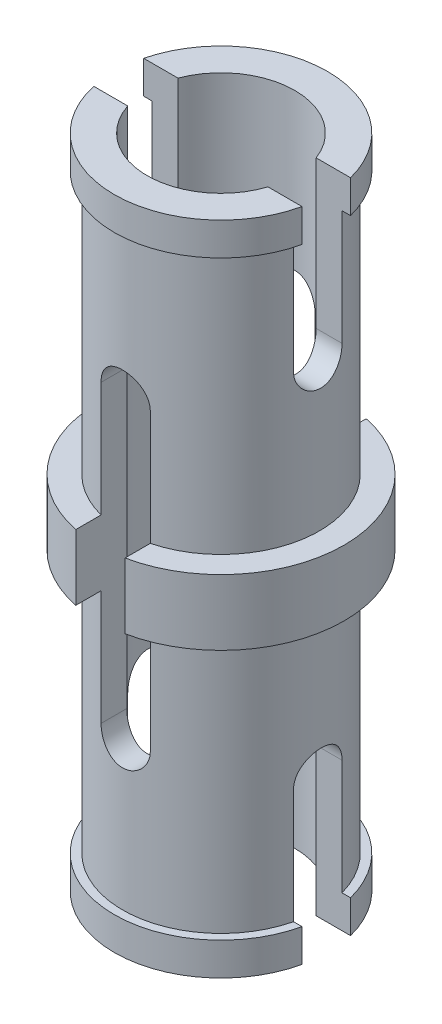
ISO-10303-21;
HEADER;
FILE_DESCRIPTION(('STEP AP214'),'2;1');
FILE_NAME('part.step','',(''),(''),'','','');
FILE_SCHEMA(('AUTOMOTIVE_DESIGN { 1 0 10303 214 1 1 1 1 }'));
ENDSEC;
DATA;
#1=APPLICATION_CONTEXT('core data for automotive mechanical design processes');
#2=APPLICATION_PROTOCOL_DEFINITION('international standard','automotive_design',2000,#1);
#3=PRODUCT_CONTEXT('',#1,'mechanical');
#4=PRODUCT('Part','Part','',(#3));
#5=PRODUCT_RELATED_PRODUCT_CATEGORY('part','',(#4));
#6=PRODUCT_DEFINITION_FORMATION('','',#4);
#7=PRODUCT_DEFINITION_CONTEXT('part definition',#1,'design');
#8=PRODUCT_DEFINITION('design','',#6,#7);
#9=PRODUCT_DEFINITION_SHAPE('','',#8);
#10=(LENGTH_UNIT() NAMED_UNIT(*) SI_UNIT(.MILLI.,.METRE.));
#11=(NAMED_UNIT(*) PLANE_ANGLE_UNIT() SI_UNIT($,.RADIAN.));
#12=(NAMED_UNIT(*) SI_UNIT($,.STERADIAN.) SOLID_ANGLE_UNIT());
#13=UNCERTAINTY_MEASURE_WITH_UNIT(LENGTH_MEASURE(1.E-05),#10,'distance_accuracy_value','');
#14=(GEOMETRIC_REPRESENTATION_CONTEXT(3) GLOBAL_UNCERTAINTY_ASSIGNED_CONTEXT((#13)) GLOBAL_UNIT_ASSIGNED_CONTEXT((#10,
#11,#12)) REPRESENTATION_CONTEXT('',''));
#15=CARTESIAN_POINT('',(0.,0.,0.));
#16=DIRECTION('',(0.,0.,1.));
#17=DIRECTION('',(1.,0.,0.));
#18=AXIS2_PLACEMENT_3D('',#15,#16,#17);
#19=CARTESIAN_POINT('',(0.,-8.,0.));
#20=DIRECTION('',(0.,1.,0.));
#21=DIRECTION('',(0.,0.,1.));
#22=AXIS2_PLACEMENT_3D('',#19,#20,#21);
#23=CYLINDRICAL_SURFACE('',#22,2.4);
#24=CARTESIAN_POINT('',(-0.599999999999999,-3.6,2.32379000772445));
#25=CARTESIAN_POINT('',(-0.600031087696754,-3.63319369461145,2.32376171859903));
#26=CARTESIAN_POINT('',(-0.597247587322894,-3.66636660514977,2.32450050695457));
#27=CARTESIAN_POINT('',(-0.586295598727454,-3.73168786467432,2.3272975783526));
#28=CARTESIAN_POINT('',(-0.578138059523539,-3.76383815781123,2.32935317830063));
#29=CARTESIAN_POINT('',(-0.556681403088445,-3.82627052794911,2.33457057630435));
#30=CARTESIAN_POINT('',(-0.543382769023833,-3.85655278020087,2.33773227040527));
#31=CARTESIAN_POINT('',(-0.512048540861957,-3.91446801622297,2.34479533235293));
#32=CARTESIAN_POINT('',(-0.494011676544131,-3.94210028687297,2.34869689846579));
#33=CARTESIAN_POINT('',(-0.453290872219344,-3.99452601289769,2.35689742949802));
#34=CARTESIAN_POINT('',(-0.430522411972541,-4.01925284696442,2.36120270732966));
#35=CARTESIAN_POINT('',(-0.381165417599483,-4.06458133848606,2.36967066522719));
#36=CARTESIAN_POINT('',(-0.354576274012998,-4.08518233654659,2.37383332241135));
#37=CARTESIAN_POINT('',(-0.297874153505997,-4.1219465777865,2.38161708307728));
#38=CARTESIAN_POINT('',(-0.267717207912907,-4.1380439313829,2.38522982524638));
#39=CARTESIAN_POINT('',(-0.205021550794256,-4.16491484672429,2.39143408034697));
#40=CARTESIAN_POINT('',(-0.172483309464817,-4.17568945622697,2.39402579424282));
#41=CARTESIAN_POINT('',(-0.106646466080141,-4.19139539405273,2.39785139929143));
#42=CARTESIAN_POINT('',(-0.0733765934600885,-4.19644060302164,2.39911171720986));
#43=CARTESIAN_POINT('',(-0.00643966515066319,-4.20090202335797,2.40022462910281));
#44=CARTESIAN_POINT('',(0.0272273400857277,-4.20031894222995,2.40007740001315));
#45=CARTESIAN_POINT('',(0.093211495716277,-4.19362202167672,2.3984114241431));
#46=CARTESIAN_POINT('',(0.125542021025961,-4.18763123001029,2.39692319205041));
#47=CARTESIAN_POINT('',(0.18872322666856,-4.17048679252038,2.39277798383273));
#48=CARTESIAN_POINT('',(0.219573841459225,-4.15933291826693,2.39012095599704));
#49=CARTESIAN_POINT('',(0.27924437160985,-4.13207923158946,2.38388998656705));
#50=CARTESIAN_POINT('',(0.308043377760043,-4.11593556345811,2.38030796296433));
#51=CARTESIAN_POINT('',(0.362565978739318,-4.07919412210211,2.37261567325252));
#52=CARTESIAN_POINT('',(0.38828910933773,-4.05859567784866,2.36850532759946));
#53=CARTESIAN_POINT('',(0.436661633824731,-4.0128726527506,2.36007339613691));
#54=CARTESIAN_POINT('',(0.45920946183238,-3.98764101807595,2.35574910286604));
#55=CARTESIAN_POINT('',(0.499781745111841,-3.93370207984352,2.34747700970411));
#56=CARTESIAN_POINT('',(0.517804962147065,-3.90499382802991,2.34352931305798));
#57=CARTESIAN_POINT('',(0.548882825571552,-3.8447126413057,2.33644688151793));
#58=CARTESIAN_POINT('',(0.561910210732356,-3.81312512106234,2.33331663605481));
#59=CARTESIAN_POINT('',(0.582421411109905,-3.74812984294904,2.32828235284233));
#60=CARTESIAN_POINT('',(0.589913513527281,-3.7147248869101,2.32637648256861));
#61=CARTESIAN_POINT('',(0.596342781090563,-3.66752557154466,2.32473174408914));
#62=CARTESIAN_POINT('',(0.597714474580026,-3.65404817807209,2.32437913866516));
#63=CARTESIAN_POINT('',(0.599542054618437,-3.62704932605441,2.32390837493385));
#64=CARTESIAN_POINT('',(0.599999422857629,-3.61352797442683,2.32378983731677));
#65=CARTESIAN_POINT('',(0.600000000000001,-3.6,2.32379000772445));
#66=B_SPLINE_CURVE_WITH_KNOTS('',3,(#24,#25,#26,#27,#28,#29,#30,#31,#32,#33,#34,#35,#36,#37,#38,
#39,#40,#41,#42,#43,#44,#45,#46,#47,#48,#49,#50,#51,#52,#53,#54,#55,#56,#57,#58,#59,#60,#61,#62,
#63,#64,#65),.UNSPECIFIED.,.F.,.F.,(4,2,2,2,2,2,2,2,2,2,2,2,2,2,2,2,2,2,2,2,4),(0.,
0.0994244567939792,0.198646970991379,0.297860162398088,0.397099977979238,0.498294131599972,
0.599504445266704,0.702126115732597,0.804727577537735,0.905251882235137,1.00576355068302,
1.10404426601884,1.20232932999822,1.30150404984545,1.40069371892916,1.50255757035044,
1.60444926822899,1.70688931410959,1.8091756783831,1.84980408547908,1.89036659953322),.UNSPECIFIED.);
#67=CARTESIAN_POINT('',(-0.599999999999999,-3.6,2.32379000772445));
#68=VERTEX_POINT('',#67);
#69=CARTESIAN_POINT('',(0.600000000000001,-3.6,2.32379000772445));
#70=VERTEX_POINT('',#69);
#71=EDGE_CURVE('E584',#68,#70,#66,.T.);
#72=ORIENTED_EDGE('',*,*,#71,.F.);
#73=DIRECTION('',(0.,1.,0.));
#74=VECTOR('',#73,1.);
#75=CARTESIAN_POINT('',(-0.599999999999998,-8.,2.32379000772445));
#76=LINE('',#75,#74);
#77=CARTESIAN_POINT('',(-0.599999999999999,-0.8,2.32379000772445));
#78=VERTEX_POINT('',#77);
#79=EDGE_CURVE('E591',#78,#68,#76,.F.);
#80=ORIENTED_EDGE('',*,*,#79,.F.);
#81=CARTESIAN_POINT('',(0.,-0.8,0.));
#82=DIRECTION('',(0.,1.,0.));
#83=DIRECTION('',(0.,0.,1.));
#84=AXIS2_PLACEMENT_3D('',#81,#82,#83);
#85=CIRCLE('',#84,2.4);
#86=CARTESIAN_POINT('',(-0.599999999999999,-0.8,-2.32379000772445));
#87=VERTEX_POINT('',#86);
#88=EDGE_CURVE('E346',#78,#87,#85,.F.);
#89=ORIENTED_EDGE('',*,*,#88,.T.);
#90=DIRECTION('',(0.,1.,0.));
#91=VECTOR('',#90,1.);
#92=CARTESIAN_POINT('',(-0.599999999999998,-8.,-2.32379000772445));
#93=LINE('',#92,#91);
#94=CARTESIAN_POINT('',(-0.599999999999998,-3.6,-2.32379000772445));
#95=VERTEX_POINT('',#94);
#96=EDGE_CURVE('E541',#87,#95,#93,.F.);
#97=ORIENTED_EDGE('',*,*,#96,.T.);
#98=CARTESIAN_POINT('',(-0.599999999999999,-3.6,-2.32379000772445));
#99=CARTESIAN_POINT('',(-0.600031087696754,-3.63319369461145,-2.32376171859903));
#100=CARTESIAN_POINT('',(-0.597247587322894,-3.66636660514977,-2.32450050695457));
#101=CARTESIAN_POINT('',(-0.586295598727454,-3.73168786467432,-2.3272975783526));
#102=CARTESIAN_POINT('',(-0.578138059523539,-3.76383815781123,-2.32935317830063));
#103=CARTESIAN_POINT('',(-0.556681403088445,-3.82627052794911,-2.33457057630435));
#104=CARTESIAN_POINT('',(-0.543382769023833,-3.85655278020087,-2.33773227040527));
#105=CARTESIAN_POINT('',(-0.512048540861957,-3.91446801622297,-2.34479533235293));
#106=CARTESIAN_POINT('',(-0.494011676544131,-3.94210028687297,-2.34869689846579));
#107=CARTESIAN_POINT('',(-0.453290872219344,-3.99452601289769,-2.35689742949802));
#108=CARTESIAN_POINT('',(-0.430522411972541,-4.01925284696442,-2.36120270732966));
#109=CARTESIAN_POINT('',(-0.381165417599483,-4.06458133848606,-2.36967066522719));
#110=CARTESIAN_POINT('',(-0.354576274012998,-4.08518233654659,-2.37383332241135));
#111=CARTESIAN_POINT('',(-0.297874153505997,-4.1219465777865,-2.38161708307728));
#112=CARTESIAN_POINT('',(-0.267717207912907,-4.1380439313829,-2.38522982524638));
#113=CARTESIAN_POINT('',(-0.205021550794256,-4.16491484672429,-2.39143408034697));
#114=CARTESIAN_POINT('',(-0.172483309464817,-4.17568945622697,-2.39402579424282));
#115=CARTESIAN_POINT('',(-0.106646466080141,-4.19139539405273,-2.39785139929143));
#116=CARTESIAN_POINT('',(-0.0733765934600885,-4.19644060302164,-2.39911171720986));
#117=CARTESIAN_POINT('',(-0.00643966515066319,-4.20090202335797,-2.40022462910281));
#118=CARTESIAN_POINT('',(0.0272273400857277,-4.20031894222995,-2.40007740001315));
#119=CARTESIAN_POINT('',(0.093211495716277,-4.19362202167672,-2.3984114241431));
#120=CARTESIAN_POINT('',(0.125542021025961,-4.18763123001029,-2.39692319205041));
#121=CARTESIAN_POINT('',(0.18872322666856,-4.17048679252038,-2.39277798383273));
#122=CARTESIAN_POINT('',(0.219573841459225,-4.15933291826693,-2.39012095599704));
#123=CARTESIAN_POINT('',(0.27924437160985,-4.13207923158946,-2.38388998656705));
#124=CARTESIAN_POINT('',(0.308043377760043,-4.11593556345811,-2.38030796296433));
#125=CARTESIAN_POINT('',(0.362565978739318,-4.07919412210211,-2.37261567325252));
#126=CARTESIAN_POINT('',(0.38828910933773,-4.05859567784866,-2.36850532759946));
#127=CARTESIAN_POINT('',(0.436661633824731,-4.0128726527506,-2.36007339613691));
#128=CARTESIAN_POINT('',(0.45920946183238,-3.98764101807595,-2.35574910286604));
#129=CARTESIAN_POINT('',(0.499781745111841,-3.93370207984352,-2.34747700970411));
#130=CARTESIAN_POINT('',(0.517804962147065,-3.90499382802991,-2.34352931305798));
#131=CARTESIAN_POINT('',(0.548882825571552,-3.8447126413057,-2.33644688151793));
#132=CARTESIAN_POINT('',(0.561910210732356,-3.81312512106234,-2.33331663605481));
#133=CARTESIAN_POINT('',(0.582421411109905,-3.74812984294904,-2.32828235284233));
#134=CARTESIAN_POINT('',(0.589913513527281,-3.7147248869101,-2.32637648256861));
#135=CARTESIAN_POINT('',(0.596342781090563,-3.66752557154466,-2.32473174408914));
#136=CARTESIAN_POINT('',(0.597714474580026,-3.65404817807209,-2.32437913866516));
#137=CARTESIAN_POINT('',(0.599542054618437,-3.62704932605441,-2.32390837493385));
#138=CARTESIAN_POINT('',(0.599999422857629,-3.61352797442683,-2.32378983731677));
#139=CARTESIAN_POINT('',(0.600000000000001,-3.6,-2.32379000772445));
#140=B_SPLINE_CURVE_WITH_KNOTS('',3,(#98,#99,#100,#101,#102,#103,#104,#105,#106,#107,#108,#109,
#110,#111,#112,#113,#114,#115,#116,#117,#118,#119,#120,#121,#122,#123,#124,#125,#126,#127,#128,
#129,#130,#131,#132,#133,#134,#135,#136,#137,#138,#139),.UNSPECIFIED.,.F.,.F.,(4,2,2,2,2,2,2,2,
2,2,2,2,2,2,2,2,2,2,2,2,4),(0.,0.0994244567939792,0.198646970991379,0.297860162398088,
0.397099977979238,0.498294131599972,0.599504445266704,0.702126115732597,0.804727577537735,
0.905251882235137,1.00576355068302,1.10404426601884,1.20232932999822,1.30150404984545,
1.40069371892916,1.50255757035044,1.60444926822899,1.70688931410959,1.8091756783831,
1.84980408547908,1.89036659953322),.UNSPECIFIED.);
#141=CARTESIAN_POINT('',(0.600000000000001,-3.6,-2.32379000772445));
#142=VERTEX_POINT('',#141);
#143=EDGE_CURVE('E640',#95,#142,#140,.T.);
#144=ORIENTED_EDGE('',*,*,#143,.T.);
#145=DIRECTION('',(0.,1.,0.));
#146=VECTOR('',#145,1.);
#147=CARTESIAN_POINT('',(0.600000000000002,-8.,-2.32379000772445));
#148=LINE('',#147,#146);
#149=CARTESIAN_POINT('',(0.600000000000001,-0.8,-2.32379000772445));
#150=VERTEX_POINT('',#149);
#151=EDGE_CURVE('E648',#142,#150,#148,.T.);
#152=ORIENTED_EDGE('',*,*,#151,.T.);
#153=CARTESIAN_POINT('',(0.600000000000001,-0.8,2.32379000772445));
#154=VERTEX_POINT('',#153);
#155=EDGE_CURVE('E344',#150,#154,#85,.F.);
#156=ORIENTED_EDGE('',*,*,#155,.T.);
#157=DIRECTION('',(0.,1.,0.));
#158=VECTOR('',#157,1.);
#159=CARTESIAN_POINT('',(0.600000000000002,-8.,2.32379000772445));
#160=LINE('',#159,#158);
#161=EDGE_CURVE('E618',#70,#154,#160,.T.);
#162=ORIENTED_EDGE('',*,*,#161,.F.);
#163=EDGE_LOOP('',(#72,#80,#89,#97,#144,#152,#156,#162));
#164=FACE_BOUND('',#163,.T.);
#165=CARTESIAN_POINT('',(2.31419594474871,-4.4,-0.636000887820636));
#166=CARTESIAN_POINT('',(2.31416705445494,-4.36688854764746,-0.636032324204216));
#167=CARTESIAN_POINT('',(2.31494846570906,-4.33379907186,-0.633262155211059));
#168=CARTESIAN_POINT('',(2.31791197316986,-4.26864897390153,-0.622366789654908));
#169=CARTESIAN_POINT('',(2.32009102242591,-4.23658627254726,-0.614253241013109));
#170=CARTESIAN_POINT('',(2.32563122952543,-4.17432752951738,-0.59291897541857));
#171=CARTESIAN_POINT('',(2.32899220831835,-4.14413120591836,-0.579699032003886));
#172=CARTESIAN_POINT('',(2.3365233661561,-4.08637395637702,-0.548558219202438));
#173=CARTESIAN_POINT('',(2.34069379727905,-4.05881385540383,-0.530635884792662));
#174=CARTESIAN_POINT('',(2.34951148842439,-4.00645048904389,-0.490135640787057));
#175=CARTESIAN_POINT('',(2.35416719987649,-3.98172093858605,-0.467464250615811));
#176=CARTESIAN_POINT('',(2.36339577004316,-3.93636577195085,-0.418312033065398));
#177=CARTESIAN_POINT('',(2.36796861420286,-3.91574087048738,-0.391830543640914));
#178=CARTESIAN_POINT('',(2.37664547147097,-3.87883383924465,-0.335243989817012));
#179=CARTESIAN_POINT('',(2.38073987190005,-3.86263408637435,-0.305083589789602));
#180=CARTESIAN_POINT('',(2.38794093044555,-3.83556525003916,-0.242349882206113));
#181=CARTESIAN_POINT('',(2.39104777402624,-3.8246951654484,-0.209777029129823));
#182=CARTESIAN_POINT('',(2.39591106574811,-3.80881058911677,-0.143812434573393));
#183=CARTESIAN_POINT('',(2.39769273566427,-3.80368573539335,-0.110449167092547));
#184=CARTESIAN_POINT('',(2.39984451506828,-3.79910138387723,-0.0432919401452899));
#185=CARTESIAN_POINT('',(2.40021482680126,-3.79964107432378,-0.00949804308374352));
#186=CARTESIAN_POINT('',(2.39955343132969,-3.8062910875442,0.0566712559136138));
#187=CARTESIAN_POINT('',(2.39855627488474,-3.81226289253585,0.0890610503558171));
#188=CARTESIAN_POINT('',(2.39536789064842,-3.82939472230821,0.152374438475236));
#189=CARTESIAN_POINT('',(2.39317663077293,-3.84055488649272,0.183297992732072));
#190=CARTESIAN_POINT('',(2.38785428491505,-3.86780338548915,0.243015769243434));
#191=CARTESIAN_POINT('',(2.384717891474,-3.88391956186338,0.271796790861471));
#192=CARTESIAN_POINT('',(2.37787482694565,-3.92060156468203,0.326292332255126));
#193=CARTESIAN_POINT('',(2.37416807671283,-3.94116800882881,0.352006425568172));
#194=CARTESIAN_POINT('',(2.36650518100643,-3.98678891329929,0.400334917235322));
#195=CARTESIAN_POINT('',(2.36254507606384,-4.01194503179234,0.422852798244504));
#196=CARTESIAN_POINT('',(2.35493151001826,-4.06571161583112,0.463383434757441));
#197=CARTESIAN_POINT('',(2.35127813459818,-4.09432304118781,0.481394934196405));
#198=CARTESIAN_POINT('',(2.34469483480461,-4.15444857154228,0.51250541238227));
#199=CARTESIAN_POINT('',(2.34177041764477,-4.1859824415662,0.525567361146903));
#200=CARTESIAN_POINT('',(2.337053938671,-4.25086419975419,0.546161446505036));
#201=CARTESIAN_POINT('',(2.3352602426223,-4.28420939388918,0.553701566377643));
#202=CARTESIAN_POINT('',(2.33369548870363,-4.33153564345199,0.560239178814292));
#203=CARTESIAN_POINT('',(2.33335616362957,-4.34519974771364,0.561649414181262));
#204=CARTESIAN_POINT('',(2.33290305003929,-4.37257374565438,0.563528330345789));
#205=CARTESIAN_POINT('',(2.332788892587,-4.38628352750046,0.563998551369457));
#206=CARTESIAN_POINT('',(2.33278910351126,-4.4,0.563999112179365));
#207=B_SPLINE_CURVE_WITH_KNOTS('',3,(#165,#166,#167,#168,#169,#170,#171,#172,#173,#174,#175,
#176,#177,#178,#179,#180,#181,#182,#183,#184,#185,#186,#187,#188,#189,#190,#191,#192,#193,#194,
#195,#196,#197,#198,#199,#200,#201,#202,#203,#204,#205,#206),.UNSPECIFIED.,.F.,.F.,(4,2,2,2,2,2,
2,2,2,2,2,2,2,2,2,2,2,2,2,2,4),(0.,0.0991756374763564,0.198135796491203,0.297080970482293,
0.396057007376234,0.497203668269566,0.59836792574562,0.701303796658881,0.804220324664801,
0.905124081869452,1.00601337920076,1.10440000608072,1.20278927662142,1.30174169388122,
1.40070785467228,1.50221456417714,1.60374953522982,1.70602980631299,1.80816191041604,
1.84935705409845,1.89048464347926),.UNSPECIFIED.);
#208=CARTESIAN_POINT('',(2.31419594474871,-4.4,-0.636000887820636));
#209=VERTEX_POINT('',#208);
#210=CARTESIAN_POINT('',(2.33278910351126,-4.4,0.563999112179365));
#211=VERTEX_POINT('',#210);
#212=EDGE_CURVE('E455',#209,#211,#207,.T.);
#213=ORIENTED_EDGE('',*,*,#212,.F.);
#214=DIRECTION('',(0.,1.,0.));
#215=VECTOR('',#214,1.);
#216=CARTESIAN_POINT('',(2.31419594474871,-8.,-0.636000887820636));
#217=LINE('',#216,#215);
#218=CARTESIAN_POINT('',(2.31419594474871,-7.2,-0.636000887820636));
#219=VERTEX_POINT('',#218);
#220=EDGE_CURVE('E461',#219,#209,#217,.T.);
#221=ORIENTED_EDGE('',*,*,#220,.F.);
#222=CARTESIAN_POINT('',(0.,-7.2,0.));
#223=DIRECTION('',(0.,-1.,0.));
#224=DIRECTION('',(0.,0.,-1.));
#225=AXIS2_PLACEMENT_3D('',#222,#223,#224);
#226=CIRCLE('',#225,2.4);
#227=CARTESIAN_POINT('',(-2.31419594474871,-7.2,-0.636000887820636));
#228=VERTEX_POINT('',#227);
#229=EDGE_CURVE('E37',#219,#228,#226,.F.);
#230=ORIENTED_EDGE('',*,*,#229,.T.);
#231=DIRECTION('',(0.,1.,0.));
#232=VECTOR('',#231,1.);
#233=CARTESIAN_POINT('',(-2.31419594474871,-8.,-0.636000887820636));
#234=LINE('',#233,#232);
#235=CARTESIAN_POINT('',(-2.31419594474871,-4.4,-0.636000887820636));
#236=VERTEX_POINT('',#235);
#237=EDGE_CURVE('E298',#228,#236,#234,.T.);
#238=ORIENTED_EDGE('',*,*,#237,.T.);
#239=CARTESIAN_POINT('',(-2.31419594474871,-4.4,-0.636000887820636));
#240=CARTESIAN_POINT('',(-2.31416705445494,-4.36688854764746,-0.636032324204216));
#241=CARTESIAN_POINT('',(-2.31494846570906,-4.33379907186,-0.633262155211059));
#242=CARTESIAN_POINT('',(-2.31791197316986,-4.26864897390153,-0.622366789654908));
#243=CARTESIAN_POINT('',(-2.32009102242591,-4.23658627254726,-0.614253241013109));
#244=CARTESIAN_POINT('',(-2.32563122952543,-4.17432752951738,-0.59291897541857));
#245=CARTESIAN_POINT('',(-2.32899220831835,-4.14413120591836,-0.579699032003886));
#246=CARTESIAN_POINT('',(-2.3365233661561,-4.08637395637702,-0.548558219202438));
#247=CARTESIAN_POINT('',(-2.34069379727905,-4.05881385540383,-0.530635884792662));
#248=CARTESIAN_POINT('',(-2.34951148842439,-4.00645048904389,-0.490135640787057));
#249=CARTESIAN_POINT('',(-2.35416719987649,-3.98172093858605,-0.467464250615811));
#250=CARTESIAN_POINT('',(-2.36339577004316,-3.93636577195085,-0.418312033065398));
#251=CARTESIAN_POINT('',(-2.36796861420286,-3.91574087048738,-0.391830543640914));
#252=CARTESIAN_POINT('',(-2.37664547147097,-3.87883383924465,-0.335243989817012));
#253=CARTESIAN_POINT('',(-2.38073987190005,-3.86263408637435,-0.305083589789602));
#254=CARTESIAN_POINT('',(-2.38794093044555,-3.83556525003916,-0.242349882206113));
#255=CARTESIAN_POINT('',(-2.39104777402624,-3.8246951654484,-0.209777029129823));
#256=CARTESIAN_POINT('',(-2.39591106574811,-3.80881058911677,-0.143812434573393));
#257=CARTESIAN_POINT('',(-2.39769273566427,-3.80368573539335,-0.110449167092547));
#258=CARTESIAN_POINT('',(-2.39984451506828,-3.79910138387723,-0.0432919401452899));
#259=CARTESIAN_POINT('',(-2.40021482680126,-3.79964107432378,-0.00949804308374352));
#260=CARTESIAN_POINT('',(-2.39955343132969,-3.8062910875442,0.0566712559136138));
#261=CARTESIAN_POINT('',(-2.39855627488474,-3.81226289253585,0.0890610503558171));
#262=CARTESIAN_POINT('',(-2.39536789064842,-3.82939472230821,0.152374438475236));
#263=CARTESIAN_POINT('',(-2.39317663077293,-3.84055488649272,0.183297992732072));
#264=CARTESIAN_POINT('',(-2.38785428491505,-3.86780338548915,0.243015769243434));
#265=CARTESIAN_POINT('',(-2.384717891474,-3.88391956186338,0.271796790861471));
#266=CARTESIAN_POINT('',(-2.37787482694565,-3.92060156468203,0.326292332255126));
#267=CARTESIAN_POINT('',(-2.37416807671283,-3.94116800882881,0.352006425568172));
#268=CARTESIAN_POINT('',(-2.36650518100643,-3.98678891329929,0.400334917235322));
#269=CARTESIAN_POINT('',(-2.36254507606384,-4.01194503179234,0.422852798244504));
#270=CARTESIAN_POINT('',(-2.35493151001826,-4.06571161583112,0.463383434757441));
#271=CARTESIAN_POINT('',(-2.35127813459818,-4.09432304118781,0.481394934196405));
#272=CARTESIAN_POINT('',(-2.34469483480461,-4.15444857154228,0.51250541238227));
#273=CARTESIAN_POINT('',(-2.34177041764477,-4.1859824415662,0.525567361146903));
#274=CARTESIAN_POINT('',(-2.337053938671,-4.25086419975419,0.546161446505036));
#275=CARTESIAN_POINT('',(-2.3352602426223,-4.28420939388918,0.553701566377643));
#276=CARTESIAN_POINT('',(-2.33369548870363,-4.33153564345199,0.560239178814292));
#277=CARTESIAN_POINT('',(-2.33335616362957,-4.34519974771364,0.561649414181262));
#278=CARTESIAN_POINT('',(-2.33290305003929,-4.37257374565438,0.563528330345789));
#279=CARTESIAN_POINT('',(-2.332788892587,-4.38628352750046,0.563998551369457));
#280=CARTESIAN_POINT('',(-2.33278910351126,-4.4,0.563999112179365));
#281=B_SPLINE_CURVE_WITH_KNOTS('',3,(#239,#240,#241,#242,#243,#244,#245,#246,#247,#248,#249,
#250,#251,#252,#253,#254,#255,#256,#257,#258,#259,#260,#261,#262,#263,#264,#265,#266,#267,#268,
#269,#270,#271,#272,#273,#274,#275,#276,#277,#278,#279,#280),.UNSPECIFIED.,.F.,.F.,(4,2,2,2,2,2,
2,2,2,2,2,2,2,2,2,2,2,2,2,2,4),(0.,0.0991756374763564,0.198135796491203,0.297080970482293,
0.396057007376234,0.497203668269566,0.59836792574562,0.701303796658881,0.804220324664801,
0.905124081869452,1.00601337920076,1.10440000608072,1.20278927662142,1.30174169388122,
1.40070785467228,1.50221456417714,1.60374953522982,1.70602980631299,1.80816191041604,
1.84935705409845,1.89048464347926),.UNSPECIFIED.);
#282=CARTESIAN_POINT('',(-2.33278910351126,-4.4,0.563999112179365));
#283=VERTEX_POINT('',#282);
#284=EDGE_CURVE('E839',#236,#283,#281,.T.);
#285=ORIENTED_EDGE('',*,*,#284,.T.);
#286=DIRECTION('',(0.,1.,0.));
#287=VECTOR('',#286,1.);
#288=CARTESIAN_POINT('',(-2.33278910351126,-8.,0.563999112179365));
#289=LINE('',#288,#287);
#290=CARTESIAN_POINT('',(-2.33278910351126,-7.2,0.563999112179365));
#291=VERTEX_POINT('',#290);
#292=EDGE_CURVE('E831',#283,#291,#289,.F.);
#293=ORIENTED_EDGE('',*,*,#292,.T.);
#294=CARTESIAN_POINT('',(2.33278910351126,-7.2,0.563999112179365));
#295=VERTEX_POINT('',#294);
#296=EDGE_CURVE('E336',#291,#295,#226,.F.);
#297=ORIENTED_EDGE('',*,*,#296,.T.);
#298=DIRECTION('',(0.,1.,0.));
#299=VECTOR('',#298,1.);
#300=CARTESIAN_POINT('',(2.33278910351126,-8.,0.563999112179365));
#301=LINE('',#300,#299);
#302=EDGE_CURVE('E379',#211,#295,#301,.F.);
#303=ORIENTED_EDGE('',*,*,#302,.F.);
#304=EDGE_LOOP('',(#213,#221,#230,#238,#285,#293,#297,#303));
#305=FACE_BOUND('',#304,.T.);
#306=ADVANCED_FACE('F34',(#164,#305),#23,.T.);
#307=DIRECTION('',(0.,1.,0.));
#308=VECTOR('',#307,1.);
#309=CARTESIAN_POINT('',(-2.3141959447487,-8.,-0.636000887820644));
#310=LINE('',#309,#308);
#311=CARTESIAN_POINT('',(-2.31419594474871,4.4,-0.636000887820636));
#312=VERTEX_POINT('',#311);
#313=CARTESIAN_POINT('',(-2.31419594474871,7.2,-0.636000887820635));
#314=VERTEX_POINT('',#313);
#315=EDGE_CURVE('E412',#312,#314,#310,.T.);
#316=ORIENTED_EDGE('',*,*,#315,.T.);
#317=CARTESIAN_POINT('',(0.,7.2,0.));
#318=DIRECTION('',(0.,1.,0.));
#319=DIRECTION('',(0.,0.,1.));
#320=AXIS2_PLACEMENT_3D('',#317,#318,#319);
#321=CIRCLE('',#320,2.4);
#322=CARTESIAN_POINT('',(2.31419594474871,7.2,-0.636000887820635));
#323=VERTEX_POINT('',#322);
#324=EDGE_CURVE('E350',#314,#323,#321,.F.);
#325=ORIENTED_EDGE('',*,*,#324,.T.);
#326=DIRECTION('',(0.,1.,0.));
#327=VECTOR('',#326,1.);
#328=CARTESIAN_POINT('',(2.3141959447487,-8.,-0.636000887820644));
#329=LINE('',#328,#327);
#330=CARTESIAN_POINT('',(2.3141959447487,4.4,-0.636000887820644));
#331=VERTEX_POINT('',#330);
#332=EDGE_CURVE('E525',#331,#323,#329,.T.);
#333=ORIENTED_EDGE('',*,*,#332,.F.);
#334=CARTESIAN_POINT('',(2.33278910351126,4.4,0.563999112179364));
#335=CARTESIAN_POINT('',(2.33276139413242,4.36672987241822,0.564029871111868));
#336=CARTESIAN_POINT('',(2.33345744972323,4.33347938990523,0.561233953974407));
#337=CARTESIAN_POINT('',(2.33608745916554,4.2679988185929,0.550229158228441));
#338=CARTESIAN_POINT('',(2.33801906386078,4.23576691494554,0.542030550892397));
#339=CARTESIAN_POINT('',(2.34291191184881,4.17317273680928,0.52045954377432));
#340=CARTESIAN_POINT('',(2.34587311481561,4.14281038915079,0.507087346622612));
#341=CARTESIAN_POINT('',(2.35246488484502,4.08474815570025,0.475572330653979));
#342=CARTESIAN_POINT('',(2.35609560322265,4.05704887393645,0.457428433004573));
#343=CARTESIAN_POINT('',(2.36367594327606,4.00456762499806,0.416503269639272));
#344=CARTESIAN_POINT('',(2.36763004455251,3.97984541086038,0.393646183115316));
#345=CARTESIAN_POINT('',(2.37533585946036,3.93454589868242,0.344103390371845));
#346=CARTESIAN_POINT('',(2.379087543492,3.91396920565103,0.31741712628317));
#347=CARTESIAN_POINT('',(2.38598095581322,3.87734115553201,0.26061596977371));
#348=CARTESIAN_POINT('',(2.38911577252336,3.8613402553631,0.230467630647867));
#349=CARTESIAN_POINT('',(2.39433139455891,3.83465445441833,0.167820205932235));
#350=CARTESIAN_POINT('',(2.3964124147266,3.8239684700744,0.13532160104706));
#351=CARTESIAN_POINT('',(2.39921078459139,3.80842450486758,0.0696140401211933));
#352=CARTESIAN_POINT('',(2.39995547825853,3.80345043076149,0.0364337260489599));
#353=CARTESIAN_POINT('',(2.40004059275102,3.79909659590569,-0.030292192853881));
#354=CARTESIAN_POINT('',(2.3993811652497,3.7997162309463,-0.0638377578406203));
#355=CARTESIAN_POINT('',(2.39671750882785,3.8064490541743,-0.129650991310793));
#356=CARTESIAN_POINT('',(2.39473976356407,3.8124548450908,-0.161930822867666));
#357=CARTESIAN_POINT('',(2.38963964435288,3.82960683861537,-0.224997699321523));
#358=CARTESIAN_POINT('',(2.38651720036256,3.84075335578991,-0.255784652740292));
#359=CARTESIAN_POINT('',(2.379374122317,3.86801247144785,-0.315424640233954));
#360=CARTESIAN_POINT('',(2.37534288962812,3.88418459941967,-0.344249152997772));
#361=CARTESIAN_POINT('',(2.36679352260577,3.92099020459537,-0.398813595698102));
#362=CARTESIAN_POINT('',(2.36227530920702,3.9416244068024,-0.424553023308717));
#363=CARTESIAN_POINT('',(2.35306501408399,3.98745743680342,-0.472980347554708));
#364=CARTESIAN_POINT('',(2.34837161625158,4.01276832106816,-0.495562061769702));
#365=CARTESIAN_POINT('',(2.33943193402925,4.06688952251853,-0.536183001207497));
#366=CARTESIAN_POINT('',(2.33518576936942,4.09570077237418,-0.554221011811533));
#367=CARTESIAN_POINT('',(2.32759951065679,4.15614535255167,-0.58526722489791));
#368=CARTESIAN_POINT('',(2.32426236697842,4.18778743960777,-0.598259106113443));
#369=CARTESIAN_POINT('',(2.31890963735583,4.25289885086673,-0.618685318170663));
#370=CARTESIAN_POINT('',(2.31689200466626,4.28636525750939,-0.626128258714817));
#371=CARTESIAN_POINT('',(2.31517011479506,4.33343496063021,-0.632447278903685));
#372=CARTESIAN_POINT('',(2.31480532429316,4.3467212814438,-0.633780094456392));
#373=CARTESIAN_POINT('',(2.31431836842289,4.3733362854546,-0.635555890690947));
#374=CARTESIAN_POINT('',(2.31419581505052,4.3866648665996,-0.636000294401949));
#375=CARTESIAN_POINT('',(2.31419594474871,4.4,-0.636000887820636));
#376=B_SPLINE_CURVE_WITH_KNOTS('',3,(#334,#335,#336,#337,#338,#339,#340,#341,#342,#343,#344,
#345,#346,#347,#348,#349,#350,#351,#352,#353,#354,#355,#356,#357,#358,#359,#360,#361,#362,#363,
#364,#365,#366,#367,#368,#369,#370,#371,#372,#373,#374,#375),.UNSPECIFIED.,.F.,.F.,(4,2,2,2,2,2,
2,2,2,2,2,2,2,2,2,2,2,2,2,2,4),(0.,0.0996557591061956,0.199122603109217,0.298585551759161,
0.398071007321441,0.499303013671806,0.600549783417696,0.702873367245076,0.805176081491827,
0.905360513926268,1.00553412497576,1.10375367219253,1.20197923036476,1.30141574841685,
1.40086843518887,1.50311818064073,1.60539523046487,1.70800038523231,1.81044600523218,
1.85049461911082,1.89047903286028),.UNSPECIFIED.);
#377=CARTESIAN_POINT('',(2.33278910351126,4.4,0.563999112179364));
#378=VERTEX_POINT('',#377);
#379=EDGE_CURVE('E504',#378,#331,#376,.T.);
#380=ORIENTED_EDGE('',*,*,#379,.F.);
#381=DIRECTION('',(0.,1.,0.));
#382=VECTOR('',#381,1.);
#383=CARTESIAN_POINT('',(2.33278910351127,-8.,0.563999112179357));
#384=LINE('',#383,#382);
#385=CARTESIAN_POINT('',(2.33278910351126,7.2,0.563999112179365));
#386=VERTEX_POINT('',#385);
#387=EDGE_CURVE('E510',#386,#378,#384,.F.);
#388=ORIENTED_EDGE('',*,*,#387,.F.);
#389=CARTESIAN_POINT('',(-2.33278910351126,7.2,0.563999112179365));
#390=VERTEX_POINT('',#389);
#391=EDGE_CURVE('E348',#386,#390,#321,.F.);
#392=ORIENTED_EDGE('',*,*,#391,.T.);
#393=DIRECTION('',(0.,1.,0.));
#394=VECTOR('',#393,1.);
#395=CARTESIAN_POINT('',(-2.33278910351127,-8.,0.563999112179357));
#396=LINE('',#395,#394);
#397=CARTESIAN_POINT('',(-2.33278910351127,4.4,0.563999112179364));
#398=VERTEX_POINT('',#397);
#399=EDGE_CURVE('E426',#390,#398,#396,.F.);
#400=ORIENTED_EDGE('',*,*,#399,.T.);
#401=CARTESIAN_POINT('',(-2.33278910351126,4.4,0.563999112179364));
#402=CARTESIAN_POINT('',(-2.33276139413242,4.36672987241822,0.564029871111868));
#403=CARTESIAN_POINT('',(-2.33345744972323,4.33347938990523,0.561233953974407));
#404=CARTESIAN_POINT('',(-2.33608745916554,4.2679988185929,0.550229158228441));
#405=CARTESIAN_POINT('',(-2.33801906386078,4.23576691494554,0.542030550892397));
#406=CARTESIAN_POINT('',(-2.34291191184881,4.17317273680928,0.52045954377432));
#407=CARTESIAN_POINT('',(-2.34587311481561,4.14281038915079,0.507087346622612));
#408=CARTESIAN_POINT('',(-2.35246488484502,4.08474815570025,0.475572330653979));
#409=CARTESIAN_POINT('',(-2.35609560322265,4.05704887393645,0.457428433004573));
#410=CARTESIAN_POINT('',(-2.36367594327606,4.00456762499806,0.416503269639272));
#411=CARTESIAN_POINT('',(-2.36763004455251,3.97984541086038,0.393646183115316));
#412=CARTESIAN_POINT('',(-2.37533585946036,3.93454589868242,0.344103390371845));
#413=CARTESIAN_POINT('',(-2.379087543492,3.91396920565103,0.31741712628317));
#414=CARTESIAN_POINT('',(-2.38598095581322,3.87734115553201,0.26061596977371));
#415=CARTESIAN_POINT('',(-2.38911577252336,3.8613402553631,0.230467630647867));
#416=CARTESIAN_POINT('',(-2.39433139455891,3.83465445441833,0.167820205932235));
#417=CARTESIAN_POINT('',(-2.3964124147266,3.8239684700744,0.13532160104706));
#418=CARTESIAN_POINT('',(-2.39921078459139,3.80842450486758,0.0696140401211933));
#419=CARTESIAN_POINT('',(-2.39995547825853,3.80345043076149,0.0364337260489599));
#420=CARTESIAN_POINT('',(-2.40004059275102,3.79909659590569,-0.030292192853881));
#421=CARTESIAN_POINT('',(-2.3993811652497,3.7997162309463,-0.0638377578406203));
#422=CARTESIAN_POINT('',(-2.39671750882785,3.8064490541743,-0.129650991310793));
#423=CARTESIAN_POINT('',(-2.39473976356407,3.8124548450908,-0.161930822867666));
#424=CARTESIAN_POINT('',(-2.38963964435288,3.82960683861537,-0.224997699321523));
#425=CARTESIAN_POINT('',(-2.38651720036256,3.84075335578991,-0.255784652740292));
#426=CARTESIAN_POINT('',(-2.379374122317,3.86801247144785,-0.315424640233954));
#427=CARTESIAN_POINT('',(-2.37534288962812,3.88418459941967,-0.344249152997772));
#428=CARTESIAN_POINT('',(-2.36679352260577,3.92099020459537,-0.398813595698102));
#429=CARTESIAN_POINT('',(-2.36227530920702,3.9416244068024,-0.424553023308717));
#430=CARTESIAN_POINT('',(-2.35306501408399,3.98745743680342,-0.472980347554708));
#431=CARTESIAN_POINT('',(-2.34837161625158,4.01276832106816,-0.495562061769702));
#432=CARTESIAN_POINT('',(-2.33943193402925,4.06688952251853,-0.536183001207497));
#433=CARTESIAN_POINT('',(-2.33518576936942,4.09570077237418,-0.554221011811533));
#434=CARTESIAN_POINT('',(-2.32759951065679,4.15614535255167,-0.58526722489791));
#435=CARTESIAN_POINT('',(-2.32426236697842,4.18778743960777,-0.598259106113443));
#436=CARTESIAN_POINT('',(-2.31890963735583,4.25289885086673,-0.618685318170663));
#437=CARTESIAN_POINT('',(-2.31689200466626,4.28636525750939,-0.626128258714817));
#438=CARTESIAN_POINT('',(-2.31517011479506,4.33343496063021,-0.632447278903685));
#439=CARTESIAN_POINT('',(-2.31480532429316,4.3467212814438,-0.633780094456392));
#440=CARTESIAN_POINT('',(-2.31431836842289,4.3733362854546,-0.635555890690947));
#441=CARTESIAN_POINT('',(-2.31419581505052,4.3866648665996,-0.636000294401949));
#442=CARTESIAN_POINT('',(-2.31419594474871,4.4,-0.636000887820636));
#443=B_SPLINE_CURVE_WITH_KNOTS('',3,(#401,#402,#403,#404,#405,#406,#407,#408,#409,#410,#411,
#412,#413,#414,#415,#416,#417,#418,#419,#420,#421,#422,#423,#424,#425,#426,#427,#428,#429,#430,
#431,#432,#433,#434,#435,#436,#437,#438,#439,#440,#441,#442),.UNSPECIFIED.,.F.,.F.,(4,2,2,2,2,2,
2,2,2,2,2,2,2,2,2,2,2,2,2,2,4),(0.,0.0996557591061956,0.199122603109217,0.298585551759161,
0.398071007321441,0.499303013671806,0.600549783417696,0.702873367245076,0.805176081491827,
0.905360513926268,1.00553412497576,1.10375367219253,1.20197923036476,1.30141574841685,
1.40086843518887,1.50311818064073,1.60539523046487,1.70800038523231,1.81044600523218,
1.85049461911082,1.89047903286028),.UNSPECIFIED.);
#444=EDGE_CURVE('E405',#398,#312,#443,.T.);
#445=ORIENTED_EDGE('',*,*,#444,.T.);
#446=EDGE_LOOP('',(#316,#325,#333,#380,#388,#392,#400,#445));
#447=FACE_BOUND('',#446,.T.);
#448=CARTESIAN_POINT('',(0.,0.8,0.));
#449=DIRECTION('',(0.,1.,0.));
#450=DIRECTION('',(0.,0.,1.));
#451=AXIS2_PLACEMENT_3D('',#448,#449,#450);
#452=CIRCLE('',#451,2.4);
#453=CARTESIAN_POINT('',(-0.599999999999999,0.8,2.32379000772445));
#454=VERTEX_POINT('',#453);
#455=CARTESIAN_POINT('',(-0.599999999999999,0.8,-2.32379000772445));
#456=VERTEX_POINT('',#455);
#457=EDGE_CURVE('E11',#454,#456,#452,.F.);
#458=ORIENTED_EDGE('',*,*,#457,.F.);
#459=DIRECTION('',(0.,1.,0.));
#460=VECTOR('',#459,1.);
#461=CARTESIAN_POINT('',(-0.599999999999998,-8.,2.32379000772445));
#462=LINE('',#461,#460);
#463=CARTESIAN_POINT('',(-0.599999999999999,3.6,2.32379000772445));
#464=VERTEX_POINT('',#463);
#465=EDGE_CURVE('E581',#464,#454,#462,.F.);
#466=ORIENTED_EDGE('',*,*,#465,.F.);
#467=CARTESIAN_POINT('',(0.600000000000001,3.6,2.32379000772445));
#468=CARTESIAN_POINT('',(0.600031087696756,3.63319369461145,2.32376171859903));
#469=CARTESIAN_POINT('',(0.597247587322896,3.66636660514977,2.32450050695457));
#470=CARTESIAN_POINT('',(0.586295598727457,3.73168786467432,2.3272975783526));
#471=CARTESIAN_POINT('',(0.578138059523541,3.76383815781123,2.32935317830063));
#472=CARTESIAN_POINT('',(0.556681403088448,3.82627052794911,2.33457057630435));
#473=CARTESIAN_POINT('',(0.543382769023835,3.85655278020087,2.33773227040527));
#474=CARTESIAN_POINT('',(0.512048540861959,3.91446801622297,2.34479533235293));
#475=CARTESIAN_POINT('',(0.494011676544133,3.94210028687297,2.34869689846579));
#476=CARTESIAN_POINT('',(0.453290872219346,3.99452601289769,2.35689742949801));
#477=CARTESIAN_POINT('',(0.430522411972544,4.01925284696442,2.36120270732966));
#478=CARTESIAN_POINT('',(0.381165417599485,4.06458133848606,2.36967066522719));
#479=CARTESIAN_POINT('',(0.354576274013,4.08518233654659,2.37383332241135));
#480=CARTESIAN_POINT('',(0.297874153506,4.1219465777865,2.38161708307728));
#481=CARTESIAN_POINT('',(0.26771720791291,4.1380439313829,2.38522982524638));
#482=CARTESIAN_POINT('',(0.205021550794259,4.16491484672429,2.39143408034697));
#483=CARTESIAN_POINT('',(0.172483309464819,4.17568945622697,2.39402579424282));
#484=CARTESIAN_POINT('',(0.106646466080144,4.19139539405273,2.39785139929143));
#485=CARTESIAN_POINT('',(0.0733765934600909,4.19644060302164,2.39911171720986));
#486=CARTESIAN_POINT('',(0.00643966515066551,4.20090202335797,2.40022462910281));
#487=CARTESIAN_POINT('',(-0.0272273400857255,4.20031894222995,2.40007740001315));
#488=CARTESIAN_POINT('',(-0.0932114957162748,4.19362202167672,2.3984114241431));
#489=CARTESIAN_POINT('',(-0.125542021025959,4.18763123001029,2.39692319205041));
#490=CARTESIAN_POINT('',(-0.188723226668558,4.17048679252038,2.39277798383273));
#491=CARTESIAN_POINT('',(-0.219573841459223,4.15933291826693,2.39012095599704));
#492=CARTESIAN_POINT('',(-0.279244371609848,4.13207923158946,2.38388998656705));
#493=CARTESIAN_POINT('',(-0.308043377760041,4.11593556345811,2.38030796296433));
#494=CARTESIAN_POINT('',(-0.362565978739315,4.07919412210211,2.37261567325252));
#495=CARTESIAN_POINT('',(-0.388289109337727,4.05859567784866,2.36850532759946));
#496=CARTESIAN_POINT('',(-0.436661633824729,4.01287265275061,2.36007339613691));
#497=CARTESIAN_POINT('',(-0.459209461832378,3.98764101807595,2.35574910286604));
#498=CARTESIAN_POINT('',(-0.499781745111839,3.93370207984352,2.34747700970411));
#499=CARTESIAN_POINT('',(-0.517804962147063,3.90499382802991,2.34352931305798));
#500=CARTESIAN_POINT('',(-0.54888282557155,3.8447126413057,2.33644688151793));
#501=CARTESIAN_POINT('',(-0.561910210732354,3.81312512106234,2.33331663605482));
#502=CARTESIAN_POINT('',(-0.582421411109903,3.74812984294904,2.32828235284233));
#503=CARTESIAN_POINT('',(-0.589913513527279,3.7147248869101,2.32637648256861));
#504=CARTESIAN_POINT('',(-0.596342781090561,3.66752557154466,2.32473174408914));
#505=CARTESIAN_POINT('',(-0.597714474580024,3.65404817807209,2.32437913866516));
#506=CARTESIAN_POINT('',(-0.599542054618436,3.62704932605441,2.32390837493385));
#507=CARTESIAN_POINT('',(-0.599999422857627,3.61352797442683,2.32378983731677));
#508=CARTESIAN_POINT('',(-0.599999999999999,3.6,2.32379000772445));
#509=B_SPLINE_CURVE_WITH_KNOTS('',3,(#467,#468,#469,#470,#471,#472,#473,#474,#475,#476,#477,
#478,#479,#480,#481,#482,#483,#484,#485,#486,#487,#488,#489,#490,#491,#492,#493,#494,#495,#496,
#497,#498,#499,#500,#501,#502,#503,#504,#505,#506,#507,#508),.UNSPECIFIED.,.F.,.F.,(4,2,2,2,2,2,
2,2,2,2,2,2,2,2,2,2,2,2,2,2,4),(0.,0.0994244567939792,0.198646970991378,0.297860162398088,
0.397099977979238,0.498294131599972,0.599504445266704,0.702126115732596,0.804727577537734,
0.905251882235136,1.00576355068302,1.10404426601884,1.20232932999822,1.30150404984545,
1.40069371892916,1.50255757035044,1.60444926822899,1.70688931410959,1.8091756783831,
1.84980408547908,1.89036659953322),.UNSPECIFIED.);
#510=CARTESIAN_POINT('',(0.600000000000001,3.6,2.32379000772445));
#511=VERTEX_POINT('',#510);
#512=EDGE_CURVE('E573',#511,#464,#509,.T.);
#513=ORIENTED_EDGE('',*,*,#512,.F.);
#514=DIRECTION('',(0.,1.,0.));
#515=VECTOR('',#514,1.);
#516=CARTESIAN_POINT('',(0.600000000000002,-8.,2.32379000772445));
#517=LINE('',#516,#515);
#518=CARTESIAN_POINT('',(0.600000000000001,0.8,2.32379000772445));
#519=VERTEX_POINT('',#518);
#520=EDGE_CURVE('E612',#519,#511,#517,.T.);
#521=ORIENTED_EDGE('',*,*,#520,.F.);
#522=CARTESIAN_POINT('',(0.600000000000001,0.8,-2.32379000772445));
#523=VERTEX_POINT('',#522);
#524=EDGE_CURVE('E42',#523,#519,#452,.F.);
#525=ORIENTED_EDGE('',*,*,#524,.F.);
#526=DIRECTION('',(0.,1.,0.));
#527=VECTOR('',#526,1.);
#528=CARTESIAN_POINT('',(0.600000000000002,-8.,-2.32379000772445));
#529=LINE('',#528,#527);
#530=CARTESIAN_POINT('',(0.600000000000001,3.6,-2.32379000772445));
#531=VERTEX_POINT('',#530);
#532=EDGE_CURVE('E649',#523,#531,#529,.T.);
#533=ORIENTED_EDGE('',*,*,#532,.T.);
#534=CARTESIAN_POINT('',(0.600000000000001,3.6,-2.32379000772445));
#535=CARTESIAN_POINT('',(0.600031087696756,3.63319369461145,-2.32376171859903));
#536=CARTESIAN_POINT('',(0.597247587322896,3.66636660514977,-2.32450050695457));
#537=CARTESIAN_POINT('',(0.586295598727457,3.73168786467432,-2.3272975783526));
#538=CARTESIAN_POINT('',(0.578138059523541,3.76383815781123,-2.32935317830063));
#539=CARTESIAN_POINT('',(0.556681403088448,3.82627052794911,-2.33457057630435));
#540=CARTESIAN_POINT('',(0.543382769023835,3.85655278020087,-2.33773227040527));
#541=CARTESIAN_POINT('',(0.512048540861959,3.91446801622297,-2.34479533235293));
#542=CARTESIAN_POINT('',(0.494011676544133,3.94210028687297,-2.34869689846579));
#543=CARTESIAN_POINT('',(0.453290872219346,3.99452601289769,-2.35689742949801));
#544=CARTESIAN_POINT('',(0.430522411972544,4.01925284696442,-2.36120270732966));
#545=CARTESIAN_POINT('',(0.381165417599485,4.06458133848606,-2.36967066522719));
#546=CARTESIAN_POINT('',(0.354576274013,4.08518233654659,-2.37383332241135));
#547=CARTESIAN_POINT('',(0.297874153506,4.1219465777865,-2.38161708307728));
#548=CARTESIAN_POINT('',(0.26771720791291,4.1380439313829,-2.38522982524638));
#549=CARTESIAN_POINT('',(0.205021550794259,4.16491484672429,-2.39143408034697));
#550=CARTESIAN_POINT('',(0.172483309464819,4.17568945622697,-2.39402579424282));
#551=CARTESIAN_POINT('',(0.106646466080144,4.19139539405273,-2.39785139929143));
#552=CARTESIAN_POINT('',(0.0733765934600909,4.19644060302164,-2.39911171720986));
#553=CARTESIAN_POINT('',(0.00643966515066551,4.20090202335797,-2.40022462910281));
#554=CARTESIAN_POINT('',(-0.0272273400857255,4.20031894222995,-2.40007740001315));
#555=CARTESIAN_POINT('',(-0.0932114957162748,4.19362202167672,-2.3984114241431));
#556=CARTESIAN_POINT('',(-0.125542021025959,4.18763123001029,-2.39692319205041));
#557=CARTESIAN_POINT('',(-0.188723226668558,4.17048679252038,-2.39277798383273));
#558=CARTESIAN_POINT('',(-0.219573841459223,4.15933291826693,-2.39012095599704));
#559=CARTESIAN_POINT('',(-0.279244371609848,4.13207923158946,-2.38388998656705));
#560=CARTESIAN_POINT('',(-0.308043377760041,4.11593556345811,-2.38030796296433));
#561=CARTESIAN_POINT('',(-0.362565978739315,4.07919412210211,-2.37261567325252));
#562=CARTESIAN_POINT('',(-0.388289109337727,4.05859567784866,-2.36850532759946));
#563=CARTESIAN_POINT('',(-0.436661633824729,4.01287265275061,-2.36007339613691));
#564=CARTESIAN_POINT('',(-0.459209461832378,3.98764101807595,-2.35574910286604));
#565=CARTESIAN_POINT('',(-0.499781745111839,3.93370207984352,-2.34747700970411));
#566=CARTESIAN_POINT('',(-0.517804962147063,3.90499382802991,-2.34352931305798));
#567=CARTESIAN_POINT('',(-0.54888282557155,3.8447126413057,-2.33644688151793));
#568=CARTESIAN_POINT('',(-0.561910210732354,3.81312512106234,-2.33331663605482));
#569=CARTESIAN_POINT('',(-0.582421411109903,3.74812984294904,-2.32828235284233));
#570=CARTESIAN_POINT('',(-0.589913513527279,3.7147248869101,-2.32637648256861));
#571=CARTESIAN_POINT('',(-0.596342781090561,3.66752557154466,-2.32473174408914));
#572=CARTESIAN_POINT('',(-0.597714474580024,3.65404817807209,-2.32437913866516));
#573=CARTESIAN_POINT('',(-0.599542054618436,3.62704932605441,-2.32390837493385));
#574=CARTESIAN_POINT('',(-0.599999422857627,3.61352797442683,-2.32378983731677));
#575=CARTESIAN_POINT('',(-0.599999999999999,3.6,-2.32379000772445));
#576=B_SPLINE_CURVE_WITH_KNOTS('',3,(#534,#535,#536,#537,#538,#539,#540,#541,#542,#543,#544,
#545,#546,#547,#548,#549,#550,#551,#552,#553,#554,#555,#556,#557,#558,#559,#560,#561,#562,#563,
#564,#565,#566,#567,#568,#569,#570,#571,#572,#573,#574,#575),.UNSPECIFIED.,.F.,.F.,(4,2,2,2,2,2,
2,2,2,2,2,2,2,2,2,2,2,2,2,2,4),(0.,0.0994244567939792,0.198646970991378,0.297860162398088,
0.397099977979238,0.498294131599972,0.599504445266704,0.702126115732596,0.804727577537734,
0.905251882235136,1.00576355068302,1.10404426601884,1.20232932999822,1.30150404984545,
1.40069371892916,1.50255757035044,1.60444926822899,1.70688931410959,1.8091756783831,
1.84980408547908,1.89036659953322),.UNSPECIFIED.);
#577=CARTESIAN_POINT('',(-0.599999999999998,3.6,-2.32379000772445));
#578=VERTEX_POINT('',#577);
#579=EDGE_CURVE('E654',#531,#578,#576,.T.);
#580=ORIENTED_EDGE('',*,*,#579,.T.);
#581=DIRECTION('',(0.,1.,0.));
#582=VECTOR('',#581,1.);
#583=CARTESIAN_POINT('',(-0.599999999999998,-8.,-2.32379000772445));
#584=LINE('',#583,#582);
#585=EDGE_CURVE('E759',#578,#456,#584,.F.);
#586=ORIENTED_EDGE('',*,*,#585,.T.);
#587=EDGE_LOOP('',(#458,#466,#513,#521,#525,#533,#580,#586));
#588=FACE_BOUND('',#587,.T.);
#589=ADVANCED_FACE('F700',(#447,#588),#23,.T.);
#590=CARTESIAN_POINT('',(0.,-8.001,0.));
#591=DIRECTION('',(0.,1.,0.));
#592=DIRECTION('',(0.,0.,1.));
#593=AXIS2_PLACEMENT_3D('',#590,#591,#592);
#594=CYLINDRICAL_SURFACE('',#593,1.8);
#595=CARTESIAN_POINT('',(0.,8.,0.));
#596=DIRECTION('',(0.,1.,0.));
#597=DIRECTION('',(0.,0.,1.));
#598=AXIS2_PLACEMENT_3D('',#595,#596,#597);
#599=CIRCLE('',#598,1.8);
#600=CARTESIAN_POINT('',(1.68389514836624,8.,-0.636000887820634));
#601=VERTEX_POINT('',#600);
#602=CARTESIAN_POINT('',(-1.68389514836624,8.,-0.636000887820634));
#603=VERTEX_POINT('',#602);
#604=EDGE_CURVE('E750',#601,#603,#599,.T.);
#605=ORIENTED_EDGE('',*,*,#604,.T.);
#606=DIRECTION('',(0.,1.,0.));
#607=VECTOR('',#606,1.);
#608=CARTESIAN_POINT('',(-1.68389514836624,-8.001,-0.636000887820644));
#609=LINE('',#608,#607);
#610=CARTESIAN_POINT('',(-1.68389514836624,4.4,-0.636000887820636));
#611=VERTEX_POINT('',#610);
#612=EDGE_CURVE('E393',#611,#603,#609,.T.);
#613=ORIENTED_EDGE('',*,*,#612,.F.);
#614=CARTESIAN_POINT('',(-1.70935806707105,4.4,0.563999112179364));
#615=CARTESIAN_POINT('',(-1.70932037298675,4.36711164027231,0.564031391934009));
#616=CARTESIAN_POINT('',(-1.71024942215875,4.33425199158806,0.561297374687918));
#617=CARTESIAN_POINT('',(-1.71375044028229,4.26958551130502,0.550559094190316));
#618=CARTESIAN_POINT('',(-1.71631781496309,4.2377759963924,0.542569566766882));
#619=CARTESIAN_POINT('',(-1.72280644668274,4.17602531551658,0.521584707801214));
#620=CARTESIAN_POINT('',(-1.72672709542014,4.14608331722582,0.508591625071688));
#621=CARTESIAN_POINT('',(-1.73544511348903,4.08878005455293,0.478000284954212));
#622=CARTESIAN_POINT('',(-1.7402429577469,4.06142020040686,0.46039953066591));
#623=CARTESIAN_POINT('',(-1.75033491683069,4.0091229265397,0.420433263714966));
#624=CARTESIAN_POINT('',(-1.7556398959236,3.98428879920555,0.397935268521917));
#625=CARTESIAN_POINT('',(-1.76600042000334,3.93867545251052,0.349091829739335));
#626=CARTESIAN_POINT('',(-1.7710559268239,3.91789685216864,0.322745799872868));
#627=CARTESIAN_POINT('',(-1.78042720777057,3.88059201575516,0.266293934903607));
#628=CARTESIAN_POINT('',(-1.78472624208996,3.86415872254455,0.236123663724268));
#629=CARTESIAN_POINT('',(-1.79191844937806,3.83663830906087,0.173281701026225));
#630=CARTESIAN_POINT('',(-1.79481207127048,3.82554948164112,0.140610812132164));
#631=CARTESIAN_POINT('',(-1.79872916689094,3.80941226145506,0.0749415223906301));
#632=CARTESIAN_POINT('',(-1.79981571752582,3.80416235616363,0.0419964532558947));
#633=CARTESIAN_POINT('',(-1.80014085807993,3.7991936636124,-0.02431442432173));
#634=CARTESIAN_POINT('',(-1.79937982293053,3.79947375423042,-0.0576801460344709));
#635=CARTESIAN_POINT('',(-1.79610015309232,3.80542682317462,-0.12266663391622));
#636=CARTESIAN_POINT('',(-1.79364305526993,3.81091343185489,-0.15430788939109));
#637=CARTESIAN_POINT('',(-1.7872430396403,3.8267994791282,-0.216171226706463));
#638=CARTESIAN_POINT('',(-1.78330000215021,3.83719931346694,-0.246393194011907));
#639=CARTESIAN_POINT('',(-1.77418914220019,3.86281055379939,-0.305214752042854));
#640=CARTESIAN_POINT('',(-1.76899957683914,3.87810919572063,-0.333772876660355));
#641=CARTESIAN_POINT('',(-1.75790903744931,3.91301324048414,-0.3879719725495));
#642=CARTESIAN_POINT('',(-1.75200785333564,3.93261991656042,-0.413612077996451));
#643=CARTESIAN_POINT('',(-1.7397352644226,3.9767269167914,-0.462590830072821));
#644=CARTESIAN_POINT('',(-1.73335504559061,4.00142150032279,-0.485752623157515));
#645=CARTESIAN_POINT('',(-1.72106282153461,4.05443268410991,-0.5276560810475));
#646=CARTESIAN_POINT('',(-1.71515096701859,4.0827504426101,-0.546396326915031));
#647=CARTESIAN_POINT('',(-1.70439148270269,4.14265311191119,-0.579094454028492));
#648=CARTESIAN_POINT('',(-1.69955692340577,4.17427195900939,-0.592994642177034));
#649=CARTESIAN_POINT('',(-1.69165142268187,4.23960313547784,-0.615188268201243));
#650=CARTESIAN_POINT('',(-1.68857749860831,4.27331181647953,-0.623491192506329));
#651=CARTESIAN_POINT('',(-1.68569640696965,4.32279572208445,-0.631215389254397));
#652=CARTESIAN_POINT('',(-1.68502273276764,4.33818322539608,-0.633009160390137));
#653=CARTESIAN_POINT('',(-1.68412187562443,4.369044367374,-0.635401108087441));
#654=CARTESIAN_POINT('',(-1.68389413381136,4.38451787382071,-0.636000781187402));
#655=CARTESIAN_POINT('',(-1.68389514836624,4.4,-0.636000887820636));
#656=B_SPLINE_CURVE_WITH_KNOTS('',3,(#614,#615,#616,#617,#618,#619,#620,#621,#622,#623,#624,
#625,#626,#627,#628,#629,#630,#631,#632,#633,#634,#635,#636,#637,#638,#639,#640,#641,#642,#643,
#644,#645,#646,#647,#648,#649,#650,#651,#652,#653,#654,#655),.UNSPECIFIED.,.F.,.F.,(4,2,2,2,2,2,
2,2,2,2,2,2,2,2,2,2,2,2,2,2,4),(0.,0.0984939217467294,0.196712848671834,0.294887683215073,
0.393115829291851,0.494434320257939,0.595768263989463,0.699120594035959,0.802439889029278,
0.902070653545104,1.00168120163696,1.09785552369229,1.1940375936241,1.29203776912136,
1.39006694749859,1.49295073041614,1.59586748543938,1.69997207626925,1.80389978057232,
1.85037424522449,1.89679042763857),.UNSPECIFIED.);
#657=CARTESIAN_POINT('',(-1.70935806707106,4.4,0.563999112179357));
#658=VERTEX_POINT('',#657);
#659=EDGE_CURVE('E376',#658,#611,#656,.T.);
#660=ORIENTED_EDGE('',*,*,#659,.F.);
#661=DIRECTION('',(0.,1.,0.));
#662=VECTOR('',#661,1.);
#663=CARTESIAN_POINT('',(-1.70935806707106,-8.001,0.563999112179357));
#664=LINE('',#663,#662);
#665=CARTESIAN_POINT('',(-1.70935806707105,8.,0.563999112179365));
#666=VERTEX_POINT('',#665);
#667=EDGE_CURVE('E428',#666,#658,#664,.F.);
#668=ORIENTED_EDGE('',*,*,#667,.F.);
#669=CARTESIAN_POINT('',(1.70935806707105,8.,0.563999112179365));
#670=VERTEX_POINT('',#669);
#671=EDGE_CURVE('E620',#666,#670,#599,.T.);
#672=ORIENTED_EDGE('',*,*,#671,.T.);
#673=DIRECTION('',(0.,1.,0.));
#674=VECTOR('',#673,1.);
#675=CARTESIAN_POINT('',(1.70935806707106,-8.001,0.563999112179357));
#676=LINE('',#675,#674);
#677=CARTESIAN_POINT('',(1.70935806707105,4.4,0.563999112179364));
#678=VERTEX_POINT('',#677);
#679=EDGE_CURVE('E493',#670,#678,#676,.F.);
#680=ORIENTED_EDGE('',*,*,#679,.T.);
#681=CARTESIAN_POINT('',(1.70935806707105,4.4,0.563999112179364));
#682=CARTESIAN_POINT('',(1.70932037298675,4.36711164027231,0.564031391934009));
#683=CARTESIAN_POINT('',(1.71024942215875,4.33425199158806,0.561297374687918));
#684=CARTESIAN_POINT('',(1.71375044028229,4.26958551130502,0.550559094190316));
#685=CARTESIAN_POINT('',(1.71631781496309,4.2377759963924,0.542569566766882));
#686=CARTESIAN_POINT('',(1.72280644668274,4.17602531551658,0.521584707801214));
#687=CARTESIAN_POINT('',(1.72672709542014,4.14608331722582,0.508591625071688));
#688=CARTESIAN_POINT('',(1.73544511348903,4.08878005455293,0.478000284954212));
#689=CARTESIAN_POINT('',(1.7402429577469,4.06142020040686,0.46039953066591));
#690=CARTESIAN_POINT('',(1.75033491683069,4.0091229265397,0.420433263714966));
#691=CARTESIAN_POINT('',(1.7556398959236,3.98428879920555,0.397935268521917));
#692=CARTESIAN_POINT('',(1.76600042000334,3.93867545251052,0.349091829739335));
#693=CARTESIAN_POINT('',(1.7710559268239,3.91789685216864,0.322745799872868));
#694=CARTESIAN_POINT('',(1.78042720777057,3.88059201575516,0.266293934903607));
#695=CARTESIAN_POINT('',(1.78472624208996,3.86415872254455,0.236123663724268));
#696=CARTESIAN_POINT('',(1.79191844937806,3.83663830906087,0.173281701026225));
#697=CARTESIAN_POINT('',(1.79481207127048,3.82554948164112,0.140610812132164));
#698=CARTESIAN_POINT('',(1.79872916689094,3.80941226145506,0.0749415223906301));
#699=CARTESIAN_POINT('',(1.79981571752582,3.80416235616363,0.0419964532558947));
#700=CARTESIAN_POINT('',(1.80014085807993,3.7991936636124,-0.02431442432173));
#701=CARTESIAN_POINT('',(1.79937982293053,3.79947375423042,-0.0576801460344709));
#702=CARTESIAN_POINT('',(1.79610015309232,3.80542682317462,-0.12266663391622));
#703=CARTESIAN_POINT('',(1.79364305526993,3.81091343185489,-0.15430788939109));
#704=CARTESIAN_POINT('',(1.7872430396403,3.8267994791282,-0.216171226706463));
#705=CARTESIAN_POINT('',(1.78330000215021,3.83719931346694,-0.246393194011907));
#706=CARTESIAN_POINT('',(1.77418914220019,3.86281055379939,-0.305214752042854));
#707=CARTESIAN_POINT('',(1.76899957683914,3.87810919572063,-0.333772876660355));
#708=CARTESIAN_POINT('',(1.75790903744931,3.91301324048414,-0.3879719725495));
#709=CARTESIAN_POINT('',(1.75200785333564,3.93261991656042,-0.413612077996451));
#710=CARTESIAN_POINT('',(1.7397352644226,3.9767269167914,-0.462590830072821));
#711=CARTESIAN_POINT('',(1.73335504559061,4.00142150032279,-0.485752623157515));
#712=CARTESIAN_POINT('',(1.72106282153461,4.05443268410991,-0.5276560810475));
#713=CARTESIAN_POINT('',(1.71515096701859,4.0827504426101,-0.546396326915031));
#714=CARTESIAN_POINT('',(1.70439148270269,4.14265311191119,-0.579094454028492));
#715=CARTESIAN_POINT('',(1.69955692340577,4.17427195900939,-0.592994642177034));
#716=CARTESIAN_POINT('',(1.69165142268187,4.23960313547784,-0.615188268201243));
#717=CARTESIAN_POINT('',(1.68857749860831,4.27331181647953,-0.623491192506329));
#718=CARTESIAN_POINT('',(1.68569640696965,4.32279572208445,-0.631215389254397));
#719=CARTESIAN_POINT('',(1.68502273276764,4.33818322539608,-0.633009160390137));
#720=CARTESIAN_POINT('',(1.68412187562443,4.369044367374,-0.635401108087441));
#721=CARTESIAN_POINT('',(1.68389413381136,4.38451787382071,-0.636000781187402));
#722=CARTESIAN_POINT('',(1.68389514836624,4.4,-0.636000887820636));
#723=B_SPLINE_CURVE_WITH_KNOTS('',3,(#681,#682,#683,#684,#685,#686,#687,#688,#689,#690,#691,
#692,#693,#694,#695,#696,#697,#698,#699,#700,#701,#702,#703,#704,#705,#706,#707,#708,#709,#710,
#711,#712,#713,#714,#715,#716,#717,#718,#719,#720,#721,#722),.UNSPECIFIED.,.F.,.F.,(4,2,2,2,2,2,
2,2,2,2,2,2,2,2,2,2,2,2,2,2,4),(0.,0.0984939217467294,0.196712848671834,0.294887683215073,
0.393115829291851,0.494434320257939,0.595768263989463,0.699120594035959,0.802439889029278,
0.902070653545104,1.00168120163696,1.09785552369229,1.1940375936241,1.29203776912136,
1.39006694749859,1.49295073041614,1.59586748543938,1.69997207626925,1.80389978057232,
1.85037424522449,1.89679042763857),.UNSPECIFIED.);
#724=CARTESIAN_POINT('',(1.68389514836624,4.4,-0.636000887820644));
#725=VERTEX_POINT('',#724);
#726=EDGE_CURVE('E484',#678,#725,#723,.T.);
#727=ORIENTED_EDGE('',*,*,#726,.T.);
#728=DIRECTION('',(0.,1.,0.));
#729=VECTOR('',#728,1.);
#730=CARTESIAN_POINT('',(1.68389514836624,-8.001,-0.636000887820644));
#731=LINE('',#730,#729);
#732=EDGE_CURVE('E527',#725,#601,#731,.T.);
#733=ORIENTED_EDGE('',*,*,#732,.T.);
#734=EDGE_LOOP('',(#605,#613,#660,#668,#672,#680,#727,#733));
#735=FACE_BOUND('',#734,.T.);
#736=DIRECTION('',(0.,1.,0.));
#737=VECTOR('',#736,1.);
#738=CARTESIAN_POINT('',(-0.599999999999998,-8.001,-1.69705627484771));
#739=LINE('',#738,#737);
#740=CARTESIAN_POINT('',(-0.599999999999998,3.6,-1.69705627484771));
#741=VERTEX_POINT('',#740);
#742=CARTESIAN_POINT('',(-0.599999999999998,-3.6,-1.69705627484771));
#743=VERTEX_POINT('',#742);
#744=EDGE_CURVE('E768',#741,#743,#739,.F.);
#745=ORIENTED_EDGE('',*,*,#744,.F.);
#746=CARTESIAN_POINT('',(0.600000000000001,3.6,-1.69705627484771));
#747=CARTESIAN_POINT('',(0.600032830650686,3.63275065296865,-1.69701764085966));
#748=CARTESIAN_POINT('',(0.597320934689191,3.66547046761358,-1.69800343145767));
#749=CARTESIAN_POINT('',(0.586676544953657,3.72984989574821,-1.7017244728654));
#750=CARTESIAN_POINT('',(0.578759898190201,3.76151242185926,-1.70445441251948));
#751=CARTESIAN_POINT('',(0.557977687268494,3.82297120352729,-1.71136579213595));
#752=CARTESIAN_POINT('',(0.545114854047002,3.85276847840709,-1.71554643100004));
#753=CARTESIAN_POINT('',(0.514843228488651,3.90980495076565,-1.72487343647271));
#754=CARTESIAN_POINT('',(0.497431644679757,3.93704256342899,-1.73002039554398));
#755=CARTESIAN_POINT('',(0.457831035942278,3.98923184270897,-1.74092668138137));
#756=CARTESIAN_POINT('',(0.435495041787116,4.01406884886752,-1.74670121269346));
#757=CARTESIAN_POINT('',(0.386993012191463,4.05972369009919,-1.75808314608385));
#758=CARTESIAN_POINT('',(0.36082629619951,4.08054080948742,-1.76369051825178));
#759=CARTESIAN_POINT('',(0.304562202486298,4.11808768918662,-1.77428328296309));
#760=CARTESIAN_POINT('',(0.27438005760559,4.13469658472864,-1.77924862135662));
#761=CARTESIAN_POINT('',(0.211457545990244,4.16255535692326,-1.78781765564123));
#762=CARTESIAN_POINT('',(0.178717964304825,4.17380687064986,-1.79142176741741));
#763=CARTESIAN_POINT('',(0.112817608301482,4.1902414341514,-1.79675442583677));
#764=CARTESIAN_POINT('',(0.0797111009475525,4.19562196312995,-1.79854385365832));
#765=CARTESIAN_POINT('',(0.0130193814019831,4.20078977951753,-1.80026165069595));
#766=CARTESIAN_POINT('',(-0.0205657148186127,4.20057839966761,-1.80019046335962));
#767=CARTESIAN_POINT('',(-0.0858623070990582,4.1946934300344,-1.7982362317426));
#768=CARTESIAN_POINT('',(-0.117595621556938,4.18923441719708,-1.79642436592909));
#769=CARTESIAN_POINT('',(-0.179666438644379,4.17336408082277,-1.79128176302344));
#770=CARTESIAN_POINT('',(-0.210003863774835,4.16295248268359,-1.78795094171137));
#771=CARTESIAN_POINT('',(-0.268891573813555,4.13734717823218,-1.78005400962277));
#772=CARTESIAN_POINT('',(-0.297413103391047,4.1220923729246,-1.77547222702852));
#773=CARTESIAN_POINT('',(-0.351554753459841,4.08728402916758,-1.76555032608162));
#774=CARTESIAN_POINT('',(-0.377174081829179,4.06772932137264,-1.76021000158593));
#775=CARTESIAN_POINT('',(-0.426058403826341,4.02379737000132,-1.74903763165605));
#776=CARTESIAN_POINT('',(-0.449156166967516,3.99923667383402,-1.74319427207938));
#777=CARTESIAN_POINT('',(-0.490963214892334,3.94653510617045,-1.73188494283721));
#778=CARTESIAN_POINT('',(-0.509671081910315,3.9183930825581,-1.72641909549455));
#779=CARTESIAN_POINT('',(-0.542401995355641,3.85879189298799,-1.71642018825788));
#780=CARTESIAN_POINT('',(-0.556351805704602,3.82728989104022,-1.7119020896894));
#781=CARTESIAN_POINT('',(-0.578676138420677,3.76221181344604,-1.70448658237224));
#782=CARTESIAN_POINT('',(-0.587059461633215,3.72863910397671,-1.70158661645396));
#783=CARTESIAN_POINT('',(-0.594994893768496,3.67894881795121,-1.69881925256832));
#784=CARTESIAN_POINT('',(-0.596871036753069,3.66321516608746,-1.69816000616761));
#785=CARTESIAN_POINT('',(-0.599372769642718,3.63165715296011,-1.69727822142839));
#786=CARTESIAN_POINT('',(-0.599999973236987,3.61583293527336,-1.69705511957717));
#787=CARTESIAN_POINT('',(-0.599999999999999,3.6,-1.69705627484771));
#788=B_SPLINE_CURVE_WITH_KNOTS('',3,(#746,#747,#748,#749,#750,#751,#752,#753,#754,#755,#756,
#757,#758,#759,#760,#761,#762,#763,#764,#765,#766,#767,#768,#769,#770,#771,#772,#773,#774,#775,
#776,#777,#778,#779,#780,#781,#782,#783,#784,#785,#786,#787),.UNSPECIFIED.,.F.,.F.,(4,2,2,2,2,2,
2,2,2,2,2,2,2,2,2,2,2,2,2,2,4),(0.,0.0980770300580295,0.195856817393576,0.293582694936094,
0.391368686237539,0.492607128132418,0.593863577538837,0.69776289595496,0.801630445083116,
0.90188492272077,1.00211550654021,1.09841460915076,1.19471905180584,1.29229021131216,
1.38988793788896,1.49207242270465,1.59428986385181,1.69801627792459,1.80157830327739,
1.84910747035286,1.89657518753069),.UNSPECIFIED.);
#789=CARTESIAN_POINT('',(0.600000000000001,3.6,-1.69705627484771));
#790=VERTEX_POINT('',#789);
#791=EDGE_CURVE('E672',#790,#741,#788,.T.);
#792=ORIENTED_EDGE('',*,*,#791,.F.);
#793=DIRECTION('',(0.,1.,0.));
#794=VECTOR('',#793,1.);
#795=CARTESIAN_POINT('',(0.600000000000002,-8.001,-1.69705627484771));
#796=LINE('',#795,#794);
#797=CARTESIAN_POINT('',(0.600000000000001,-3.6,-1.69705627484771));
#798=VERTEX_POINT('',#797);
#799=EDGE_CURVE('E628',#798,#790,#796,.T.);
#800=ORIENTED_EDGE('',*,*,#799,.F.);
#801=CARTESIAN_POINT('',(-0.599999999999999,-3.6,-1.69705627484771));
#802=CARTESIAN_POINT('',(-0.600032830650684,-3.63275065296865,-1.69701764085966));
#803=CARTESIAN_POINT('',(-0.597320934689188,-3.66547046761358,-1.69800343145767));
#804=CARTESIAN_POINT('',(-0.586676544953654,-3.72984989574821,-1.7017244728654));
#805=CARTESIAN_POINT('',(-0.578759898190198,-3.76151242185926,-1.70445441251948));
#806=CARTESIAN_POINT('',(-0.557977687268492,-3.82297120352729,-1.71136579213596));
#807=CARTESIAN_POINT('',(-0.545114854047,-3.85276847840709,-1.71554643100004));
#808=CARTESIAN_POINT('',(-0.514843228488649,-3.90980495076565,-1.72487343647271));
#809=CARTESIAN_POINT('',(-0.497431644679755,-3.93704256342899,-1.73002039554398));
#810=CARTESIAN_POINT('',(-0.457831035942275,-3.98923184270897,-1.74092668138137));
#811=CARTESIAN_POINT('',(-0.435495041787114,-4.01406884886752,-1.74670121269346));
#812=CARTESIAN_POINT('',(-0.386993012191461,-4.05972369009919,-1.75808314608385));
#813=CARTESIAN_POINT('',(-0.360826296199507,-4.08054080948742,-1.76369051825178));
#814=CARTESIAN_POINT('',(-0.304562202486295,-4.11808768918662,-1.77428328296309));
#815=CARTESIAN_POINT('',(-0.274380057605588,-4.13469658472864,-1.77924862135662));
#816=CARTESIAN_POINT('',(-0.211457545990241,-4.16255535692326,-1.78781765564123));
#817=CARTESIAN_POINT('',(-0.178717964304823,-4.17380687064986,-1.79142176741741));
#818=CARTESIAN_POINT('',(-0.11281760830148,-4.1902414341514,-1.79675442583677));
#819=CARTESIAN_POINT('',(-0.0797111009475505,-4.19562196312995,-1.79854385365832));
#820=CARTESIAN_POINT('',(-0.0130193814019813,-4.20078977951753,-1.80026165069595));
#821=CARTESIAN_POINT('',(0.0205657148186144,-4.20057839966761,-1.80019046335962));
#822=CARTESIAN_POINT('',(0.0858623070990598,-4.1946934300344,-1.7982362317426));
#823=CARTESIAN_POINT('',(0.11759562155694,-4.18923441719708,-1.79642436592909));
#824=CARTESIAN_POINT('',(0.17966643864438,-4.17336408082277,-1.79128176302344));
#825=CARTESIAN_POINT('',(0.210003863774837,-4.16295248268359,-1.78795094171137));
#826=CARTESIAN_POINT('',(0.268891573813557,-4.13734717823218,-1.78005400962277));
#827=CARTESIAN_POINT('',(0.297413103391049,-4.1220923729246,-1.77547222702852));
#828=CARTESIAN_POINT('',(0.351554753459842,-4.08728402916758,-1.76555032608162));
#829=CARTESIAN_POINT('',(0.377174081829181,-4.06772932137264,-1.76021000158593));
#830=CARTESIAN_POINT('',(0.426058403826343,-4.02379737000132,-1.74903763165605));
#831=CARTESIAN_POINT('',(0.449156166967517,-3.99923667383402,-1.74319427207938));
#832=CARTESIAN_POINT('',(0.490963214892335,-3.94653510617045,-1.73188494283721));
#833=CARTESIAN_POINT('',(0.509671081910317,-3.9183930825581,-1.72641909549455));
#834=CARTESIAN_POINT('',(0.542401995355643,-3.85879189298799,-1.71642018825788));
#835=CARTESIAN_POINT('',(0.556351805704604,-3.82728989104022,-1.7119020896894));
#836=CARTESIAN_POINT('',(0.578676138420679,-3.76221181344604,-1.70448658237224));
#837=CARTESIAN_POINT('',(0.587059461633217,-3.72863910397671,-1.70158661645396));
#838=CARTESIAN_POINT('',(0.594994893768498,-3.67894881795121,-1.69881925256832));
#839=CARTESIAN_POINT('',(0.596871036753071,-3.66321516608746,-1.69816000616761));
#840=CARTESIAN_POINT('',(0.59937276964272,-3.63165715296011,-1.69727822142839));
#841=CARTESIAN_POINT('',(0.599999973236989,-3.61583293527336,-1.69705511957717));
#842=CARTESIAN_POINT('',(0.600000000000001,-3.6,-1.69705627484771));
#843=B_SPLINE_CURVE_WITH_KNOTS('',3,(#801,#802,#803,#804,#805,#806,#807,#808,#809,#810,#811,
#812,#813,#814,#815,#816,#817,#818,#819,#820,#821,#822,#823,#824,#825,#826,#827,#828,#829,#830,
#831,#832,#833,#834,#835,#836,#837,#838,#839,#840,#841,#842),.UNSPECIFIED.,.F.,.F.,(4,2,2,2,2,2,
2,2,2,2,2,2,2,2,2,2,2,2,2,2,4),(0.,0.0980770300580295,0.195856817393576,0.293582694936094,
0.391368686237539,0.492607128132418,0.593863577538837,0.69776289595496,0.801630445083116,
0.901884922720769,1.00211550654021,1.09841460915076,1.19471905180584,1.29229021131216,
1.38988793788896,1.49207242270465,1.59428986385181,1.69801627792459,1.80157830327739,
1.84910747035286,1.89657518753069),.UNSPECIFIED.);
#844=EDGE_CURVE('E530',#743,#798,#843,.T.);
#845=ORIENTED_EDGE('',*,*,#844,.F.);
#846=EDGE_LOOP('',(#745,#792,#800,#845));
#847=FACE_BOUND('',#846,.T.);
#848=CARTESIAN_POINT('',(0.600000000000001,3.6,1.69705627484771));
#849=CARTESIAN_POINT('',(0.600032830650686,3.63275065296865,1.69701764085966));
#850=CARTESIAN_POINT('',(0.597320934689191,3.66547046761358,1.69800343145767));
#851=CARTESIAN_POINT('',(0.586676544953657,3.72984989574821,1.7017244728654));
#852=CARTESIAN_POINT('',(0.578759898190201,3.76151242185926,1.70445441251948));
#853=CARTESIAN_POINT('',(0.557977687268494,3.82297120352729,1.71136579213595));
#854=CARTESIAN_POINT('',(0.545114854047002,3.85276847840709,1.71554643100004));
#855=CARTESIAN_POINT('',(0.514843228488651,3.90980495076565,1.72487343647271));
#856=CARTESIAN_POINT('',(0.497431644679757,3.93704256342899,1.73002039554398));
#857=CARTESIAN_POINT('',(0.457831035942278,3.98923184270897,1.74092668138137));
#858=CARTESIAN_POINT('',(0.435495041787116,4.01406884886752,1.74670121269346));
#859=CARTESIAN_POINT('',(0.386993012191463,4.05972369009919,1.75808314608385));
#860=CARTESIAN_POINT('',(0.36082629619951,4.08054080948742,1.76369051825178));
#861=CARTESIAN_POINT('',(0.304562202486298,4.11808768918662,1.77428328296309));
#862=CARTESIAN_POINT('',(0.27438005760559,4.13469658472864,1.77924862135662));
#863=CARTESIAN_POINT('',(0.211457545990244,4.16255535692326,1.78781765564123));
#864=CARTESIAN_POINT('',(0.178717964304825,4.17380687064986,1.79142176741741));
#865=CARTESIAN_POINT('',(0.112817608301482,4.1902414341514,1.79675442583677));
#866=CARTESIAN_POINT('',(0.0797111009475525,4.19562196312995,1.79854385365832));
#867=CARTESIAN_POINT('',(0.0130193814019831,4.20078977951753,1.80026165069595));
#868=CARTESIAN_POINT('',(-0.0205657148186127,4.20057839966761,1.80019046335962));
#869=CARTESIAN_POINT('',(-0.0858623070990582,4.1946934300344,1.7982362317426));
#870=CARTESIAN_POINT('',(-0.117595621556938,4.18923441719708,1.79642436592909));
#871=CARTESIAN_POINT('',(-0.179666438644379,4.17336408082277,1.79128176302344));
#872=CARTESIAN_POINT('',(-0.210003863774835,4.16295248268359,1.78795094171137));
#873=CARTESIAN_POINT('',(-0.268891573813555,4.13734717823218,1.78005400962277));
#874=CARTESIAN_POINT('',(-0.297413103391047,4.1220923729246,1.77547222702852));
#875=CARTESIAN_POINT('',(-0.351554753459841,4.08728402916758,1.76555032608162));
#876=CARTESIAN_POINT('',(-0.377174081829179,4.06772932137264,1.76021000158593));
#877=CARTESIAN_POINT('',(-0.426058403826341,4.02379737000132,1.74903763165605));
#878=CARTESIAN_POINT('',(-0.449156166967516,3.99923667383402,1.74319427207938));
#879=CARTESIAN_POINT('',(-0.490963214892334,3.94653510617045,1.73188494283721));
#880=CARTESIAN_POINT('',(-0.509671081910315,3.9183930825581,1.72641909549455));
#881=CARTESIAN_POINT('',(-0.542401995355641,3.85879189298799,1.71642018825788));
#882=CARTESIAN_POINT('',(-0.556351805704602,3.82728989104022,1.7119020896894));
#883=CARTESIAN_POINT('',(-0.578676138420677,3.76221181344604,1.70448658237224));
#884=CARTESIAN_POINT('',(-0.587059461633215,3.72863910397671,1.70158661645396));
#885=CARTESIAN_POINT('',(-0.594994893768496,3.67894881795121,1.69881925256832));
#886=CARTESIAN_POINT('',(-0.596871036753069,3.66321516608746,1.69816000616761));
#887=CARTESIAN_POINT('',(-0.599372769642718,3.63165715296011,1.69727822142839));
#888=CARTESIAN_POINT('',(-0.599999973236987,3.61583293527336,1.69705511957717));
#889=CARTESIAN_POINT('',(-0.599999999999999,3.6,1.69705627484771));
#890=B_SPLINE_CURVE_WITH_KNOTS('',3,(#848,#849,#850,#851,#852,#853,#854,#855,#856,#857,#858,
#859,#860,#861,#862,#863,#864,#865,#866,#867,#868,#869,#870,#871,#872,#873,#874,#875,#876,#877,
#878,#879,#880,#881,#882,#883,#884,#885,#886,#887,#888,#889),.UNSPECIFIED.,.F.,.F.,(4,2,2,2,2,2,
2,2,2,2,2,2,2,2,2,2,2,2,2,2,4),(0.,0.0980770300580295,0.195856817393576,0.293582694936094,
0.391368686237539,0.492607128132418,0.593863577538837,0.69776289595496,0.801630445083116,
0.90188492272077,1.00211550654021,1.09841460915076,1.19471905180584,1.29229021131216,
1.38988793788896,1.49207242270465,1.59428986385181,1.69801627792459,1.80157830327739,
1.84910747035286,1.89657518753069),.UNSPECIFIED.);
#891=CARTESIAN_POINT('',(0.600000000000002,3.6,1.69705627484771));
#892=VERTEX_POINT('',#891);
#893=CARTESIAN_POINT('',(-0.599999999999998,3.6,1.69705627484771));
#894=VERTEX_POINT('',#893);
#895=EDGE_CURVE('E552',#892,#894,#890,.T.);
#896=ORIENTED_EDGE('',*,*,#895,.T.);
#897=DIRECTION('',(0.,1.,0.));
#898=VECTOR('',#897,1.);
#899=CARTESIAN_POINT('',(-0.599999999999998,-8.001,1.69705627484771));
#900=LINE('',#899,#898);
#901=CARTESIAN_POINT('',(-0.599999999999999,-3.6,1.69705627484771));
#902=VERTEX_POINT('',#901);
#903=EDGE_CURVE('E540',#894,#902,#900,.F.);
#904=ORIENTED_EDGE('',*,*,#903,.T.);
#905=CARTESIAN_POINT('',(-0.599999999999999,-3.6,1.69705627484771));
#906=CARTESIAN_POINT('',(-0.600032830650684,-3.63275065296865,1.69701764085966));
#907=CARTESIAN_POINT('',(-0.597320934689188,-3.66547046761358,1.69800343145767));
#908=CARTESIAN_POINT('',(-0.586676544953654,-3.72984989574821,1.7017244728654));
#909=CARTESIAN_POINT('',(-0.578759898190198,-3.76151242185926,1.70445441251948));
#910=CARTESIAN_POINT('',(-0.557977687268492,-3.82297120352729,1.71136579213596));
#911=CARTESIAN_POINT('',(-0.545114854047,-3.85276847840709,1.71554643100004));
#912=CARTESIAN_POINT('',(-0.514843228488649,-3.90980495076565,1.72487343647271));
#913=CARTESIAN_POINT('',(-0.497431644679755,-3.93704256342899,1.73002039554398));
#914=CARTESIAN_POINT('',(-0.457831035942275,-3.98923184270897,1.74092668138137));
#915=CARTESIAN_POINT('',(-0.435495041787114,-4.01406884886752,1.74670121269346));
#916=CARTESIAN_POINT('',(-0.386993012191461,-4.05972369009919,1.75808314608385));
#917=CARTESIAN_POINT('',(-0.360826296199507,-4.08054080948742,1.76369051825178));
#918=CARTESIAN_POINT('',(-0.304562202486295,-4.11808768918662,1.77428328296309));
#919=CARTESIAN_POINT('',(-0.274380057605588,-4.13469658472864,1.77924862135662));
#920=CARTESIAN_POINT('',(-0.211457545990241,-4.16255535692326,1.78781765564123));
#921=CARTESIAN_POINT('',(-0.178717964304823,-4.17380687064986,1.79142176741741));
#922=CARTESIAN_POINT('',(-0.11281760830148,-4.1902414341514,1.79675442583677));
#923=CARTESIAN_POINT('',(-0.0797111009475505,-4.19562196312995,1.79854385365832));
#924=CARTESIAN_POINT('',(-0.0130193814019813,-4.20078977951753,1.80026165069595));
#925=CARTESIAN_POINT('',(0.0205657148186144,-4.20057839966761,1.80019046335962));
#926=CARTESIAN_POINT('',(0.0858623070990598,-4.1946934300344,1.7982362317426));
#927=CARTESIAN_POINT('',(0.11759562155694,-4.18923441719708,1.79642436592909));
#928=CARTESIAN_POINT('',(0.17966643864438,-4.17336408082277,1.79128176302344));
#929=CARTESIAN_POINT('',(0.210003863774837,-4.16295248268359,1.78795094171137));
#930=CARTESIAN_POINT('',(0.268891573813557,-4.13734717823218,1.78005400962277));
#931=CARTESIAN_POINT('',(0.297413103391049,-4.1220923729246,1.77547222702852));
#932=CARTESIAN_POINT('',(0.351554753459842,-4.08728402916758,1.76555032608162));
#933=CARTESIAN_POINT('',(0.377174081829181,-4.06772932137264,1.76021000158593));
#934=CARTESIAN_POINT('',(0.426058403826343,-4.02379737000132,1.74903763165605));
#935=CARTESIAN_POINT('',(0.449156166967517,-3.99923667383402,1.74319427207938));
#936=CARTESIAN_POINT('',(0.490963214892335,-3.94653510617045,1.73188494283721));
#937=CARTESIAN_POINT('',(0.509671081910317,-3.9183930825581,1.72641909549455));
#938=CARTESIAN_POINT('',(0.542401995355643,-3.85879189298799,1.71642018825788));
#939=CARTESIAN_POINT('',(0.556351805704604,-3.82728989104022,1.7119020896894));
#940=CARTESIAN_POINT('',(0.578676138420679,-3.76221181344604,1.70448658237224));
#941=CARTESIAN_POINT('',(0.587059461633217,-3.72863910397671,1.70158661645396));
#942=CARTESIAN_POINT('',(0.594994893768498,-3.67894881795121,1.69881925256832));
#943=CARTESIAN_POINT('',(0.596871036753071,-3.66321516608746,1.69816000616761));
#944=CARTESIAN_POINT('',(0.59937276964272,-3.63165715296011,1.69727822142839));
#945=CARTESIAN_POINT('',(0.599999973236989,-3.61583293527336,1.69705511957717));
#946=CARTESIAN_POINT('',(0.600000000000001,-3.6,1.69705627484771));
#947=B_SPLINE_CURVE_WITH_KNOTS('',3,(#905,#906,#907,#908,#909,#910,#911,#912,#913,#914,#915,
#916,#917,#918,#919,#920,#921,#922,#923,#924,#925,#926,#927,#928,#929,#930,#931,#932,#933,#934,
#935,#936,#937,#938,#939,#940,#941,#942,#943,#944,#945,#946),.UNSPECIFIED.,.F.,.F.,(4,2,2,2,2,2,
2,2,2,2,2,2,2,2,2,2,2,2,2,2,4),(0.,0.0980770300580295,0.195856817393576,0.293582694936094,
0.391368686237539,0.492607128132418,0.593863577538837,0.69776289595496,0.801630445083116,
0.901884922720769,1.00211550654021,1.09841460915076,1.19471905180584,1.29229021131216,
1.38988793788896,1.49207242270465,1.59428986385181,1.69801627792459,1.80157830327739,
1.84910747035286,1.89657518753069),.UNSPECIFIED.);
#948=CARTESIAN_POINT('',(0.600000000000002,-3.6,1.69705627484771));
#949=VERTEX_POINT('',#948);
#950=EDGE_CURVE('E531',#902,#949,#947,.T.);
#951=ORIENTED_EDGE('',*,*,#950,.T.);
#952=DIRECTION('',(0.,1.,0.));
#953=VECTOR('',#952,1.);
#954=CARTESIAN_POINT('',(0.600000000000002,-8.001,1.69705627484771));
#955=LINE('',#954,#953);
#956=EDGE_CURVE('E605',#949,#892,#955,.T.);
#957=ORIENTED_EDGE('',*,*,#956,.T.);
#958=EDGE_LOOP('',(#896,#904,#951,#957));
#959=FACE_BOUND('',#958,.T.);
#960=DIRECTION('',(0.,1.,0.));
#961=VECTOR('',#960,1.);
#962=CARTESIAN_POINT('',(1.68389514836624,-8.001,-0.636000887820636));
#963=LINE('',#962,#961);
#964=CARTESIAN_POINT('',(1.68389514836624,-8.,-0.636000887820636));
#965=VERTEX_POINT('',#964);
#966=CARTESIAN_POINT('',(1.68389514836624,-4.4,-0.636000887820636));
#967=VERTEX_POINT('',#966);
#968=EDGE_CURVE('E444',#965,#967,#963,.T.);
#969=ORIENTED_EDGE('',*,*,#968,.T.);
#970=CARTESIAN_POINT('',(1.68389514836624,-4.4,-0.636000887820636));
#971=CARTESIAN_POINT('',(1.68385552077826,-4.36739781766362,-0.636034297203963));
#972=CARTESIAN_POINT('',(1.68489783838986,-4.33482871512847,-0.633346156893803));
#973=CARTESIAN_POINT('',(1.68883756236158,-4.27075833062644,-0.622802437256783));
#974=CARTESIAN_POINT('',(1.69172887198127,-4.23925389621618,-0.614963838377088));
#975=CARTESIAN_POINT('',(1.69905907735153,-4.17810905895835,-0.594398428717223));
#976=CARTESIAN_POINT('',(1.70349695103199,-4.14846744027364,-0.58167484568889));
#977=CARTESIAN_POINT('',(1.71342556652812,-4.09171855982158,-0.551744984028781));
#978=CARTESIAN_POINT('',(1.71891703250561,-4.06461306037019,-0.534535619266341));
#979=CARTESIAN_POINT('',(1.73063042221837,-4.0125461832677,-0.495329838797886));
#980=CARTESIAN_POINT('',(1.73687258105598,-3.98771107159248,-0.473171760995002));
#981=CARTESIAN_POINT('',(1.74927182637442,-3.94202156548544,-0.425047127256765));
#982=CARTESIAN_POINT('',(1.75542889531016,-3.92116798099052,-0.399079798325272));
#983=CARTESIAN_POINT('',(1.76724978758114,-3.88336804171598,-0.343035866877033));
#984=CARTESIAN_POINT('',(1.77289079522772,-3.8665723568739,-0.312852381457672));
#985=CARTESIAN_POINT('',(1.78285715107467,-3.83835082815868,-0.249870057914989));
#986=CARTESIAN_POINT('',(1.78718287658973,-3.82692344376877,-0.21707197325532));
#987=CARTESIAN_POINT('',(1.79395741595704,-3.81015903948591,-0.150943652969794));
#988=CARTESIAN_POINT('',(1.79646413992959,-3.80463119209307,-0.117667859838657));
#989=CARTESIAN_POINT('',(1.79960232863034,-3.79923441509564,-0.0505758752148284));
#990=CARTESIAN_POINT('',(1.80023430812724,-3.79936393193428,-0.0167598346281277));
#991=CARTESIAN_POINT('',(1.79962272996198,-3.80516046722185,0.0488743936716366));
#992=CARTESIAN_POINT('',(1.79846017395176,-3.81058449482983,0.0807151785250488));
#993=CARTESIAN_POINT('',(1.79458032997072,-3.82642954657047,0.14302560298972));
#994=CARTESIAN_POINT('',(1.79186299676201,-3.83685071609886,0.17349520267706));
#995=CARTESIAN_POINT('',(1.78517289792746,-3.86244953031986,0.232478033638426));
#996=CARTESIAN_POINT('',(1.78119111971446,-3.87766131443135,0.260975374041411));
#997=CARTESIAN_POINT('',(1.77242050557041,-3.91237990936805,0.315084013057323));
#998=CARTESIAN_POINT('',(1.76763146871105,-3.93188778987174,0.340694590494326));
#999=CARTESIAN_POINT('',(1.75753681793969,-3.97565671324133,0.389503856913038));
#1000=CARTESIAN_POINT('',(1.75221771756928,-4.00009005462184,0.412545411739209));
#1001=CARTESIAN_POINT('',(1.74186738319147,-4.05249981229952,0.454270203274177));
#1002=CARTESIAN_POINT('',(1.73683624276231,-4.08047737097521,0.472952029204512));
#1003=CARTESIAN_POINT('',(1.72758322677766,-4.13979332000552,0.505719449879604));
#1004=CARTESIAN_POINT('',(1.72337718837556,-4.17118228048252,0.51971817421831));
#1005=CARTESIAN_POINT('',(1.71644727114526,-4.23601710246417,0.542170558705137));
#1006=CARTESIAN_POINT('',(1.71372120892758,-4.26945985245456,0.550632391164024));
#1007=CARTESIAN_POINT('',(1.71107460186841,-4.31935320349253,0.558775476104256));
#1008=CARTESIAN_POINT('',(1.71043284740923,-4.33542364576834,0.560733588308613));
#1009=CARTESIAN_POINT('',(1.70957421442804,-4.36765989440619,0.563344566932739));
#1010=CARTESIAN_POINT('',(1.70935677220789,-4.38382554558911,0.56399916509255));
#1011=CARTESIAN_POINT('',(1.70935806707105,-4.4,0.563999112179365));
#1012=B_SPLINE_CURVE_WITH_KNOTS('',3,(#970,#971,#972,#973,#974,#975,#976,#977,#978,#979,#980,
#981,#982,#983,#984,#985,#986,#987,#988,#989,#990,#991,#992,#993,#994,#995,#996,#997,#998,#999,
#1000,#1001,#1002,#1003,#1004,#1005,#1006,#1007,#1008,#1009,#1010,#1011),.UNSPECIFIED.,.F.,.F.,
(4,2,2,2,2,2,2,2,2,2,2,2,2,2,2,2,2,2,2,2,4),(0.,0.0976276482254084,0.194935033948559,
0.292178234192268,0.389488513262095,0.490626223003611,0.591784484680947,0.696262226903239,
0.800709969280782,0.901666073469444,1.00259445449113,1.09909853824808,1.19560543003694,
1.29281624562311,1.39005129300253,1.49159441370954,1.593170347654,1.69653768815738,
1.7997521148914,1.84830806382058,1.89679946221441),.UNSPECIFIED.);
#1013=CARTESIAN_POINT('',(1.70935806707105,-4.4,0.563999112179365));
#1014=VERTEX_POINT('',#1013);
#1015=EDGE_CURVE('E435',#967,#1014,#1012,.T.);
#1016=ORIENTED_EDGE('',*,*,#1015,.T.);
#1017=DIRECTION('',(0.,1.,0.));
#1018=VECTOR('',#1017,1.);
#1019=CARTESIAN_POINT('',(1.70935806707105,-8.001,0.563999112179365));
#1020=LINE('',#1019,#1018);
#1021=CARTESIAN_POINT('',(1.70935806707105,-8.,0.563999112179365));
#1022=VERTEX_POINT('',#1021);
#1023=EDGE_CURVE('E374',#1014,#1022,#1020,.F.);
#1024=ORIENTED_EDGE('',*,*,#1023,.T.);
#1025=CARTESIAN_POINT('',(0.,-8.,0.));
#1026=DIRECTION('',(0.,1.,0.));
#1027=DIRECTION('',(0.,0.,1.));
#1028=AXIS2_PLACEMENT_3D('',#1025,#1026,#1027);
#1029=CIRCLE('',#1028,1.8);
#1030=CARTESIAN_POINT('',(-1.70935806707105,-8.,0.563999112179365));
#1031=VERTEX_POINT('',#1030);
#1032=EDGE_CURVE('E324',#1022,#1031,#1029,.F.);
#1033=ORIENTED_EDGE('',*,*,#1032,.T.);
#1034=DIRECTION('',(0.,1.,0.));
#1035=VECTOR('',#1034,1.);
#1036=CARTESIAN_POINT('',(-1.70935806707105,-8.001,0.563999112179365));
#1037=LINE('',#1036,#1035);
#1038=CARTESIAN_POINT('',(-1.70935806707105,-4.4,0.563999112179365));
#1039=VERTEX_POINT('',#1038);
#1040=EDGE_CURVE('E846',#1039,#1031,#1037,.F.);
#1041=ORIENTED_EDGE('',*,*,#1040,.F.);
#1042=CARTESIAN_POINT('',(-1.68389514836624,-4.4,-0.636000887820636));
#1043=CARTESIAN_POINT('',(-1.68385552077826,-4.36739781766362,-0.636034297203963));
#1044=CARTESIAN_POINT('',(-1.68489783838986,-4.33482871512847,-0.633346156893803));
#1045=CARTESIAN_POINT('',(-1.68883756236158,-4.27075833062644,-0.622802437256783));
#1046=CARTESIAN_POINT('',(-1.69172887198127,-4.23925389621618,-0.614963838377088));
#1047=CARTESIAN_POINT('',(-1.69905907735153,-4.17810905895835,-0.594398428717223));
#1048=CARTESIAN_POINT('',(-1.70349695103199,-4.14846744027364,-0.58167484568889));
#1049=CARTESIAN_POINT('',(-1.71342556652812,-4.09171855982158,-0.551744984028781));
#1050=CARTESIAN_POINT('',(-1.71891703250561,-4.06461306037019,-0.534535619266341));
#1051=CARTESIAN_POINT('',(-1.73063042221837,-4.0125461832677,-0.495329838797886));
#1052=CARTESIAN_POINT('',(-1.73687258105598,-3.98771107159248,-0.473171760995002));
#1053=CARTESIAN_POINT('',(-1.74927182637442,-3.94202156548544,-0.425047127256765));
#1054=CARTESIAN_POINT('',(-1.75542889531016,-3.92116798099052,-0.399079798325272));
#1055=CARTESIAN_POINT('',(-1.76724978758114,-3.88336804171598,-0.343035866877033));
#1056=CARTESIAN_POINT('',(-1.77289079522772,-3.8665723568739,-0.312852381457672));
#1057=CARTESIAN_POINT('',(-1.78285715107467,-3.83835082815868,-0.249870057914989));
#1058=CARTESIAN_POINT('',(-1.78718287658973,-3.82692344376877,-0.21707197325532));
#1059=CARTESIAN_POINT('',(-1.79395741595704,-3.81015903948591,-0.150943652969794));
#1060=CARTESIAN_POINT('',(-1.79646413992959,-3.80463119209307,-0.117667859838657));
#1061=CARTESIAN_POINT('',(-1.79960232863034,-3.79923441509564,-0.0505758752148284));
#1062=CARTESIAN_POINT('',(-1.80023430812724,-3.79936393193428,-0.0167598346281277));
#1063=CARTESIAN_POINT('',(-1.79962272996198,-3.80516046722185,0.0488743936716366));
#1064=CARTESIAN_POINT('',(-1.79846017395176,-3.81058449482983,0.0807151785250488));
#1065=CARTESIAN_POINT('',(-1.79458032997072,-3.82642954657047,0.14302560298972));
#1066=CARTESIAN_POINT('',(-1.79186299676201,-3.83685071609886,0.17349520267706));
#1067=CARTESIAN_POINT('',(-1.78517289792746,-3.86244953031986,0.232478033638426));
#1068=CARTESIAN_POINT('',(-1.78119111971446,-3.87766131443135,0.260975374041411));
#1069=CARTESIAN_POINT('',(-1.77242050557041,-3.91237990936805,0.315084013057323));
#1070=CARTESIAN_POINT('',(-1.76763146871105,-3.93188778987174,0.340694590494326));
#1071=CARTESIAN_POINT('',(-1.75753681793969,-3.97565671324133,0.389503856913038));
#1072=CARTESIAN_POINT('',(-1.75221771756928,-4.00009005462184,0.412545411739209));
#1073=CARTESIAN_POINT('',(-1.74186738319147,-4.05249981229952,0.454270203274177));
#1074=CARTESIAN_POINT('',(-1.73683624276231,-4.08047737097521,0.472952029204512));
#1075=CARTESIAN_POINT('',(-1.72758322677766,-4.13979332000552,0.505719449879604));
#1076=CARTESIAN_POINT('',(-1.72337718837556,-4.17118228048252,0.51971817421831));
#1077=CARTESIAN_POINT('',(-1.71644727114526,-4.23601710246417,0.542170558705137));
#1078=CARTESIAN_POINT('',(-1.71372120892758,-4.26945985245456,0.550632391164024));
#1079=CARTESIAN_POINT('',(-1.71107460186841,-4.31935320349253,0.558775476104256));
#1080=CARTESIAN_POINT('',(-1.71043284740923,-4.33542364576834,0.560733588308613));
#1081=CARTESIAN_POINT('',(-1.70957421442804,-4.36765989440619,0.563344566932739));
#1082=CARTESIAN_POINT('',(-1.70935677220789,-4.38382554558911,0.56399916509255));
#1083=CARTESIAN_POINT('',(-1.70935806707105,-4.4,0.563999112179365));
#1084=B_SPLINE_CURVE_WITH_KNOTS('',3,(#1042,#1043,#1044,#1045,#1046,#1047,#1048,#1049,#1050,
#1051,#1052,#1053,#1054,#1055,#1056,#1057,#1058,#1059,#1060,#1061,#1062,#1063,#1064,#1065,#1066,
#1067,#1068,#1069,#1070,#1071,#1072,#1073,#1074,#1075,#1076,#1077,#1078,#1079,#1080,#1081,#1082,
#1083),.UNSPECIFIED.,.F.,.F.,(4,2,2,2,2,2,2,2,2,2,2,2,2,2,2,2,2,2,2,2,4),(0.,0.0976276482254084,
0.194935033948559,0.292178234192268,0.389488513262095,0.490626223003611,0.591784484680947,
0.696262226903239,0.800709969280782,0.901666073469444,1.00259445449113,1.09909853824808,
1.19560543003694,1.29281624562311,1.39005129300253,1.49159441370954,1.593170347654,
1.69653768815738,1.7997521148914,1.84830806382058,1.89679946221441),.UNSPECIFIED.);
#1085=CARTESIAN_POINT('',(-1.68389514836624,-4.4,-0.636000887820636));
#1086=VERTEX_POINT('',#1085);
#1087=EDGE_CURVE('E825',#1086,#1039,#1084,.T.);
#1088=ORIENTED_EDGE('',*,*,#1087,.F.);
#1089=DIRECTION('',(0.,1.,0.));
#1090=VECTOR('',#1089,1.);
#1091=CARTESIAN_POINT('',(-1.68389514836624,-8.001,-0.636000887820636));
#1092=LINE('',#1091,#1090);
#1093=CARTESIAN_POINT('',(-1.68389514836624,-8.,-0.636000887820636));
#1094=VERTEX_POINT('',#1093);
#1095=EDGE_CURVE('E382',#1094,#1086,#1092,.T.);
#1096=ORIENTED_EDGE('',*,*,#1095,.F.);
#1097=EDGE_CURVE('E327',#1094,#965,#1029,.F.);
#1098=ORIENTED_EDGE('',*,*,#1097,.T.);
#1099=EDGE_LOOP('',(#969,#1016,#1024,#1033,#1041,#1088,#1096,#1098));
#1100=FACE_BOUND('',#1099,.T.);
#1101=ADVANCED_FACE('F669',(#735,#847,#959,#1100),#594,.F.);
#1102=CARTESIAN_POINT('',(0.,7.2,0.));
#1103=DIRECTION('',(0.,1.,0.));
#1104=DIRECTION('',(0.,0.,1.));
#1105=AXIS2_PLACEMENT_3D('',#1102,#1103,#1104);
#1106=CYLINDRICAL_SURFACE('',#1105,2.6);
#1107=DIRECTION('',(0.,1.,0.));
#1108=VECTOR('',#1107,1.);
#1109=CARTESIAN_POINT('',(-2.52101227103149,7.2,-0.636000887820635));
#1110=LINE('',#1109,#1108);
#1111=CARTESIAN_POINT('',(-2.52101227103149,7.2,-0.636000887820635));
#1112=VERTEX_POINT('',#1111);
#1113=CARTESIAN_POINT('',(-2.52101227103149,8.,-0.636000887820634));
#1114=VERTEX_POINT('',#1113);
#1115=EDGE_CURVE('E362',#1112,#1114,#1110,.T.);
#1116=ORIENTED_EDGE('',*,*,#1115,.T.);
#1117=CARTESIAN_POINT('',(0.,8.,0.));
#1118=DIRECTION('',(0.,1.,0.));
#1119=DIRECTION('',(0.,0.,1.));
#1120=AXIS2_PLACEMENT_3D('',#1117,#1118,#1119);
#1121=CIRCLE('',#1120,2.6);
#1122=CARTESIAN_POINT('',(2.52101227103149,8.,-0.636000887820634));
#1123=VERTEX_POINT('',#1122);
#1124=EDGE_CURVE('E332',#1123,#1114,#1121,.T.);
#1125=ORIENTED_EDGE('',*,*,#1124,.F.);
#1126=DIRECTION('',(0.,1.,0.));
#1127=VECTOR('',#1126,1.);
#1128=CARTESIAN_POINT('',(2.52101227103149,7.2,-0.636000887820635));
#1129=LINE('',#1128,#1127);
#1130=CARTESIAN_POINT('',(2.52101227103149,7.2,-0.636000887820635));
#1131=VERTEX_POINT('',#1130);
#1132=EDGE_CURVE('E58',#1131,#1123,#1129,.T.);
#1133=ORIENTED_EDGE('',*,*,#1132,.F.);
#1134=CARTESIAN_POINT('',(0.,7.2,0.));
#1135=DIRECTION('',(0.,1.,0.));
#1136=DIRECTION('',(0.,0.,1.));
#1137=AXIS2_PLACEMENT_3D('',#1134,#1135,#1136);
#1138=CIRCLE('',#1137,2.6);
#1139=EDGE_CURVE('E331',#1131,#1112,#1138,.T.);
#1140=ORIENTED_EDGE('',*,*,#1139,.T.);
#1141=EDGE_LOOP('',(#1116,#1125,#1133,#1140));
#1142=FACE_BOUND('',#1141,.T.);
#1143=ADVANCED_FACE('F360',(#1142),#1106,.T.);
#1144=DIRECTION('',(0.,1.,0.));
#1145=VECTOR('',#1144,1.);
#1146=CARTESIAN_POINT('',(-2.53809081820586,7.2,0.563999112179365));
#1147=LINE('',#1146,#1145);
#1148=CARTESIAN_POINT('',(-2.53809081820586,8.,0.563999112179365));
#1149=VERTEX_POINT('',#1148);
#1150=CARTESIAN_POINT('',(-2.53809081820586,7.2,0.563999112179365));
#1151=VERTEX_POINT('',#1150);
#1152=EDGE_CURVE('E50',#1149,#1151,#1147,.F.);
#1153=ORIENTED_EDGE('',*,*,#1152,.T.);
#1154=CARTESIAN_POINT('',(2.53809081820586,7.2,0.563999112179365));
#1155=VERTEX_POINT('',#1154);
#1156=EDGE_CURVE('E328',#1151,#1155,#1138,.T.);
#1157=ORIENTED_EDGE('',*,*,#1156,.T.);
#1158=DIRECTION('',(0.,1.,0.));
#1159=VECTOR('',#1158,1.);
#1160=CARTESIAN_POINT('',(2.53809081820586,7.2,0.563999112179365));
#1161=LINE('',#1160,#1159);
#1162=CARTESIAN_POINT('',(2.53809081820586,8.,0.563999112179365));
#1163=VERTEX_POINT('',#1162);
#1164=EDGE_CURVE('E482',#1163,#1155,#1161,.F.);
#1165=ORIENTED_EDGE('',*,*,#1164,.F.);
#1166=EDGE_CURVE('E333',#1149,#1163,#1121,.T.);
#1167=ORIENTED_EDGE('',*,*,#1166,.F.);
#1168=EDGE_LOOP('',(#1153,#1157,#1165,#1167));
#1169=FACE_BOUND('',#1168,.T.);
#1170=ADVANCED_FACE('F899',(#1169),#1106,.T.);
#1171=CARTESIAN_POINT('',(0.,7.2,0.));
#1172=DIRECTION('',(0.,1.,0.));
#1173=DIRECTION('',(0.,0.,1.));
#1174=AXIS2_PLACEMENT_3D('',#1171,#1172,#1173);
#1175=PLANE('',#1174);
#1176=ORIENTED_EDGE('',*,*,#324,.F.);
#1177=DIRECTION('',(1.,0.,0.));
#1178=VECTOR('',#1177,1.);
#1179=CARTESIAN_POINT('',(-3.001,7.2,-0.636000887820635));
#1180=LINE('',#1179,#1178);
#1181=EDGE_CURVE('E370',#1112,#314,#1180,.T.);
#1182=ORIENTED_EDGE('',*,*,#1181,.F.);
#1183=ORIENTED_EDGE('',*,*,#1139,.F.);
#1184=DIRECTION('',(-1.,0.,0.));
#1185=VECTOR('',#1184,1.);
#1186=CARTESIAN_POINT('',(3.001,7.2,-0.636000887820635));
#1187=LINE('',#1186,#1185);
#1188=EDGE_CURVE('E369',#1131,#323,#1187,.T.);
#1189=ORIENTED_EDGE('',*,*,#1188,.T.);
#1190=EDGE_LOOP('',(#1176,#1182,#1183,#1189));
#1191=FACE_BOUND('',#1190,.T.);
#1192=ADVANCED_FACE('F368',(#1191),#1175,.F.);
#1193=ORIENTED_EDGE('',*,*,#1156,.F.);
#1194=DIRECTION('',(-1.,0.,0.));
#1195=VECTOR('',#1194,1.);
#1196=CARTESIAN_POINT('',(-3.001,7.2,0.563999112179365));
#1197=LINE('',#1196,#1195);
#1198=EDGE_CURVE('E418',#390,#1151,#1197,.T.);
#1199=ORIENTED_EDGE('',*,*,#1198,.F.);
#1200=ORIENTED_EDGE('',*,*,#391,.F.);
#1201=DIRECTION('',(1.,0.,0.));
#1202=VECTOR('',#1201,1.);
#1203=CARTESIAN_POINT('',(3.001,7.2,0.563999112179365));
#1204=LINE('',#1203,#1202);
#1205=EDGE_CURVE('E431',#386,#1155,#1204,.T.);
#1206=ORIENTED_EDGE('',*,*,#1205,.T.);
#1207=EDGE_LOOP('',(#1193,#1199,#1200,#1206));
#1208=FACE_BOUND('',#1207,.T.);
#1209=ADVANCED_FACE('F809',(#1208),#1175,.F.);
#1210=CARTESIAN_POINT('',(0.,8.,0.));
#1211=DIRECTION('',(0.,1.,0.));
#1212=DIRECTION('',(0.,0.,1.));
#1213=AXIS2_PLACEMENT_3D('',#1210,#1211,#1212);
#1214=PLANE('',#1213);
#1215=DIRECTION('',(1.,0.,0.));
#1216=VECTOR('',#1215,1.);
#1217=CARTESIAN_POINT('',(-3.001,8.,-0.636000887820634));
#1218=LINE('',#1217,#1216);
#1219=EDGE_CURVE('E415',#1114,#603,#1218,.T.);
#1220=ORIENTED_EDGE('',*,*,#1219,.T.);
#1221=ORIENTED_EDGE('',*,*,#604,.F.);
#1222=DIRECTION('',(-1.,0.,0.));
#1223=VECTOR('',#1222,1.);
#1224=CARTESIAN_POINT('',(3.001,8.,-0.636000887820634));
#1225=LINE('',#1224,#1223);
#1226=EDGE_CURVE('E512',#1123,#601,#1225,.T.);
#1227=ORIENTED_EDGE('',*,*,#1226,.F.);
#1228=ORIENTED_EDGE('',*,*,#1124,.T.);
#1229=EDGE_LOOP('',(#1220,#1221,#1227,#1228));
#1230=FACE_BOUND('',#1229,.T.);
#1231=ADVANCED_FACE('F806',(#1230),#1214,.T.);
#1232=DIRECTION('',(1.,0.,0.));
#1233=VECTOR('',#1232,1.);
#1234=CARTESIAN_POINT('',(-3.001,8.,0.563999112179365));
#1235=LINE('',#1234,#1233);
#1236=EDGE_CURVE('E414',#1149,#666,#1235,.T.);
#1237=ORIENTED_EDGE('',*,*,#1236,.F.);
#1238=ORIENTED_EDGE('',*,*,#1166,.T.);
#1239=DIRECTION('',(-1.,0.,0.));
#1240=VECTOR('',#1239,1.);
#1241=CARTESIAN_POINT('',(3.001,8.,0.563999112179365));
#1242=LINE('',#1241,#1240);
#1243=EDGE_CURVE('E520',#1163,#670,#1242,.T.);
#1244=ORIENTED_EDGE('',*,*,#1243,.T.);
#1245=ORIENTED_EDGE('',*,*,#671,.F.);
#1246=EDGE_LOOP('',(#1237,#1238,#1244,#1245));
#1247=FACE_BOUND('',#1246,.T.);
#1248=ADVANCED_FACE('F808',(#1247),#1214,.T.);
#1249=CARTESIAN_POINT('',(0.,-7.2,0.));
#1250=DIRECTION('',(0.,-1.,0.));
#1251=DIRECTION('',(0.,0.,-1.));
#1252=AXIS2_PLACEMENT_3D('',#1249,#1250,#1251);
#1253=CYLINDRICAL_SURFACE('',#1252,2.6);
#1254=CARTESIAN_POINT('',(0.,-7.2,0.));
#1255=DIRECTION('',(0.,-1.,0.));
#1256=DIRECTION('',(0.,0.,-1.));
#1257=AXIS2_PLACEMENT_3D('',#1254,#1255,#1256);
#1258=CIRCLE('',#1257,2.6);
#1259=CARTESIAN_POINT('',(-2.52101227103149,-7.2,-0.636000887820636));
#1260=VERTEX_POINT('',#1259);
#1261=CARTESIAN_POINT('',(2.52101227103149,-7.2,-0.636000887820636));
#1262=VERTEX_POINT('',#1261);
#1263=EDGE_CURVE('E310',#1260,#1262,#1258,.T.);
#1264=ORIENTED_EDGE('',*,*,#1263,.T.);
#1265=DIRECTION('',(0.,-1.,0.));
#1266=VECTOR('',#1265,1.);
#1267=CARTESIAN_POINT('',(2.52101227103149,-7.2,-0.636000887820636));
#1268=LINE('',#1267,#1266);
#1269=CARTESIAN_POINT('',(2.52101227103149,-8.,-0.636000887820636));
#1270=VERTEX_POINT('',#1269);
#1271=EDGE_CURVE('E433',#1270,#1262,#1268,.F.);
#1272=ORIENTED_EDGE('',*,*,#1271,.F.);
#1273=CARTESIAN_POINT('',(0.,-8.,0.));
#1274=DIRECTION('',(0.,-1.,0.));
#1275=DIRECTION('',(0.,0.,-1.));
#1276=AXIS2_PLACEMENT_3D('',#1273,#1274,#1275);
#1277=CIRCLE('',#1276,2.6);
#1278=CARTESIAN_POINT('',(-2.52101227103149,-8.,-0.636000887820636));
#1279=VERTEX_POINT('',#1278);
#1280=EDGE_CURVE('E312',#1279,#1270,#1277,.T.);
#1281=ORIENTED_EDGE('',*,*,#1280,.F.);
#1282=DIRECTION('',(0.,-1.,0.));
#1283=VECTOR('',#1282,1.);
#1284=CARTESIAN_POINT('',(-2.52101227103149,-7.2,-0.636000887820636));
#1285=LINE('',#1284,#1283);
#1286=EDGE_CURVE('E295',#1279,#1260,#1285,.F.);
#1287=ORIENTED_EDGE('',*,*,#1286,.T.);
#1288=EDGE_LOOP('',(#1264,#1272,#1281,#1287));
#1289=FACE_BOUND('',#1288,.T.);
#1290=ADVANCED_FACE('F308',(#1289),#1253,.T.);
#1291=CARTESIAN_POINT('',(2.53809081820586,-8.,0.563999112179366));
#1292=VERTEX_POINT('',#1291);
#1293=CARTESIAN_POINT('',(-2.53809081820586,-8.,0.563999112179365));
#1294=VERTEX_POINT('',#1293);
#1295=EDGE_CURVE('E318',#1292,#1294,#1277,.T.);
#1296=ORIENTED_EDGE('',*,*,#1295,.F.);
#1297=DIRECTION('',(0.,-1.,0.));
#1298=VECTOR('',#1297,1.);
#1299=CARTESIAN_POINT('',(2.53809081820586,-7.2,0.563999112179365));
#1300=LINE('',#1299,#1298);
#1301=CARTESIAN_POINT('',(2.53809081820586,-7.2,0.563999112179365));
#1302=VERTEX_POINT('',#1301);
#1303=EDGE_CURVE('E477',#1302,#1292,#1300,.T.);
#1304=ORIENTED_EDGE('',*,*,#1303,.F.);
#1305=CARTESIAN_POINT('',(-2.53809081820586,-7.2,0.563999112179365));
#1306=VERTEX_POINT('',#1305);
#1307=EDGE_CURVE('E317',#1302,#1306,#1258,.T.);
#1308=ORIENTED_EDGE('',*,*,#1307,.T.);
#1309=DIRECTION('',(0.,-1.,0.));
#1310=VECTOR('',#1309,1.);
#1311=CARTESIAN_POINT('',(-2.53809081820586,-7.2,0.563999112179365));
#1312=LINE('',#1311,#1310);
#1313=EDGE_CURVE('E882',#1306,#1294,#1312,.T.);
#1314=ORIENTED_EDGE('',*,*,#1313,.T.);
#1315=EDGE_LOOP('',(#1296,#1304,#1308,#1314));
#1316=FACE_BOUND('',#1315,.T.);
#1317=ADVANCED_FACE('F881',(#1316),#1253,.T.);
#1318=CARTESIAN_POINT('',(0.,-7.2,0.));
#1319=DIRECTION('',(0.,-1.,0.));
#1320=DIRECTION('',(0.,0.,-1.));
#1321=AXIS2_PLACEMENT_3D('',#1318,#1319,#1320);
#1322=PLANE('',#1321);
#1323=DIRECTION('',(1.,0.,0.));
#1324=VECTOR('',#1323,1.);
#1325=CARTESIAN_POINT('',(3.001,-7.2,-0.636000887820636));
#1326=LINE('',#1325,#1324);
#1327=EDGE_CURVE('E316',#219,#1262,#1326,.T.);
#1328=ORIENTED_EDGE('',*,*,#1327,.T.);
#1329=ORIENTED_EDGE('',*,*,#1263,.F.);
#1330=DIRECTION('',(-1.,0.,0.));
#1331=VECTOR('',#1330,1.);
#1332=CARTESIAN_POINT('',(-3.001,-7.2,-0.636000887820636));
#1333=LINE('',#1332,#1331);
#1334=EDGE_CURVE('E291',#228,#1260,#1333,.T.);
#1335=ORIENTED_EDGE('',*,*,#1334,.F.);
#1336=ORIENTED_EDGE('',*,*,#229,.F.);
#1337=EDGE_LOOP('',(#1328,#1329,#1335,#1336));
#1338=FACE_BOUND('',#1337,.T.);
#1339=ADVANCED_FACE('F315',(#1338),#1322,.F.);
#1340=DIRECTION('',(-1.,0.,0.));
#1341=VECTOR('',#1340,1.);
#1342=CARTESIAN_POINT('',(3.001,-7.2,0.563999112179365));
#1343=LINE('',#1342,#1341);
#1344=EDGE_CURVE('E474',#1302,#295,#1343,.T.);
#1345=ORIENTED_EDGE('',*,*,#1344,.T.);
#1346=ORIENTED_EDGE('',*,*,#296,.F.);
#1347=DIRECTION('',(1.,0.,0.));
#1348=VECTOR('',#1347,1.);
#1349=CARTESIAN_POINT('',(-3.001,-7.2,0.563999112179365));
#1350=LINE('',#1349,#1348);
#1351=EDGE_CURVE('E879',#1306,#291,#1350,.T.);
#1352=ORIENTED_EDGE('',*,*,#1351,.F.);
#1353=ORIENTED_EDGE('',*,*,#1307,.F.);
#1354=EDGE_LOOP('',(#1345,#1346,#1352,#1353));
#1355=FACE_BOUND('',#1354,.T.);
#1356=ADVANCED_FACE('F811',(#1355),#1322,.F.);
#1357=CARTESIAN_POINT('',(0.,-8.,0.));
#1358=DIRECTION('',(0.,1.,0.));
#1359=DIRECTION('',(0.,0.,1.));
#1360=AXIS2_PLACEMENT_3D('',#1357,#1358,#1359);
#1361=PLANE('',#1360);
#1362=DIRECTION('',(-1.,0.,0.));
#1363=VECTOR('',#1362,1.);
#1364=CARTESIAN_POINT('',(3.001,-8.,-0.636000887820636));
#1365=LINE('',#1364,#1363);
#1366=EDGE_CURVE('E471',#1270,#965,#1365,.T.);
#1367=ORIENTED_EDGE('',*,*,#1366,.T.);
#1368=ORIENTED_EDGE('',*,*,#1097,.F.);
#1369=DIRECTION('',(1.,0.,0.));
#1370=VECTOR('',#1369,1.);
#1371=CARTESIAN_POINT('',(-3.001,-8.,-0.636000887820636));
#1372=LINE('',#1371,#1370);
#1373=EDGE_CURVE('E828',#1279,#1094,#1372,.T.);
#1374=ORIENTED_EDGE('',*,*,#1373,.F.);
#1375=ORIENTED_EDGE('',*,*,#1280,.T.);
#1376=EDGE_LOOP('',(#1367,#1368,#1374,#1375));
#1377=FACE_BOUND('',#1376,.T.);
#1378=ADVANCED_FACE('F803',(#1377),#1361,.F.);
#1379=DIRECTION('',(-1.,0.,0.));
#1380=VECTOR('',#1379,1.);
#1381=CARTESIAN_POINT('',(3.001,-8.,0.563999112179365));
#1382=LINE('',#1381,#1380);
#1383=EDGE_CURVE('E463',#1292,#1022,#1382,.T.);
#1384=ORIENTED_EDGE('',*,*,#1383,.F.);
#1385=ORIENTED_EDGE('',*,*,#1295,.T.);
#1386=DIRECTION('',(1.,0.,0.));
#1387=VECTOR('',#1386,1.);
#1388=CARTESIAN_POINT('',(-3.001,-8.,0.563999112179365));
#1389=LINE('',#1388,#1387);
#1390=EDGE_CURVE('E303',#1294,#1031,#1389,.T.);
#1391=ORIENTED_EDGE('',*,*,#1390,.T.);
#1392=ORIENTED_EDGE('',*,*,#1032,.F.);
#1393=EDGE_LOOP('',(#1384,#1385,#1391,#1392));
#1394=FACE_BOUND('',#1393,.T.);
#1395=ADVANCED_FACE('F798',(#1394),#1361,.F.);
#1396=CARTESIAN_POINT('',(0.,-0.8,0.));
#1397=DIRECTION('',(0.,1.,0.));
#1398=DIRECTION('',(0.,0.,1.));
#1399=AXIS2_PLACEMENT_3D('',#1396,#1397,#1398);
#1400=CYLINDRICAL_SURFACE('',#1399,3.);
#1401=CARTESIAN_POINT('',(0.,-0.8,0.));
#1402=DIRECTION('',(0.,1.,0.));
#1403=DIRECTION('',(0.,0.,1.));
#1404=AXIS2_PLACEMENT_3D('',#1401,#1402,#1403);
#1405=CIRCLE('',#1404,3.);
#1406=CARTESIAN_POINT('',(-0.599999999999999,-0.8,-2.93938769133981));
#1407=VERTEX_POINT('',#1406);
#1408=CARTESIAN_POINT('',(-0.599999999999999,-0.8,2.93938769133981));
#1409=VERTEX_POINT('',#1408);
#1410=EDGE_CURVE('E340',#1407,#1409,#1405,.T.);
#1411=ORIENTED_EDGE('',*,*,#1410,.T.);
#1412=DIRECTION('',(0.,1.,0.));
#1413=VECTOR('',#1412,1.);
#1414=CARTESIAN_POINT('',(-0.599999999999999,-0.8,2.93938769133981));
#1415=LINE('',#1414,#1413);
#1416=CARTESIAN_POINT('',(-0.599999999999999,0.8,2.93938769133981));
#1417=VERTEX_POINT('',#1416);
#1418=EDGE_CURVE('E582',#1417,#1409,#1415,.F.);
#1419=ORIENTED_EDGE('',*,*,#1418,.F.);
#1420=CARTESIAN_POINT('',(0.,0.8,0.));
#1421=DIRECTION('',(0.,1.,0.));
#1422=DIRECTION('',(0.,0.,1.));
#1423=AXIS2_PLACEMENT_3D('',#1420,#1421,#1422);
#1424=CIRCLE('',#1423,3.);
#1425=CARTESIAN_POINT('',(-0.599999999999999,0.8,-2.93938769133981));
#1426=VERTEX_POINT('',#1425);
#1427=EDGE_CURVE('E341',#1426,#1417,#1424,.T.);
#1428=ORIENTED_EDGE('',*,*,#1427,.F.);
#1429=DIRECTION('',(0.,1.,0.));
#1430=VECTOR('',#1429,1.);
#1431=CARTESIAN_POINT('',(-0.599999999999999,-0.8,-2.93938769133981));
#1432=LINE('',#1431,#1430);
#1433=EDGE_CURVE('E762',#1426,#1407,#1432,.F.);
#1434=ORIENTED_EDGE('',*,*,#1433,.T.);
#1435=EDGE_LOOP('',(#1411,#1419,#1428,#1434));
#1436=FACE_BOUND('',#1435,.T.);
#1437=ADVANCED_FACE('F795',(#1436),#1400,.T.);
#1438=CARTESIAN_POINT('',(0.600000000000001,0.8,2.93938769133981));
#1439=VERTEX_POINT('',#1438);
#1440=CARTESIAN_POINT('',(0.600000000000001,0.8,-2.93938769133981));
#1441=VERTEX_POINT('',#1440);
#1442=EDGE_CURVE('E337',#1439,#1441,#1424,.T.);
#1443=ORIENTED_EDGE('',*,*,#1442,.F.);
#1444=DIRECTION('',(0.,1.,0.));
#1445=VECTOR('',#1444,1.);
#1446=CARTESIAN_POINT('',(0.600000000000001,-0.8,2.93938769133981));
#1447=LINE('',#1446,#1445);
#1448=CARTESIAN_POINT('',(0.600000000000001,-0.8,2.93938769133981));
#1449=VERTEX_POINT('',#1448);
#1450=EDGE_CURVE('E610',#1449,#1439,#1447,.T.);
#1451=ORIENTED_EDGE('',*,*,#1450,.F.);
#1452=CARTESIAN_POINT('',(0.600000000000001,-0.8,-2.93938769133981));
#1453=VERTEX_POINT('',#1452);
#1454=EDGE_CURVE('E342',#1449,#1453,#1405,.T.);
#1455=ORIENTED_EDGE('',*,*,#1454,.T.);
#1456=DIRECTION('',(0.,1.,0.));
#1457=VECTOR('',#1456,1.);
#1458=CARTESIAN_POINT('',(0.600000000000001,-0.8,-2.93938769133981));
#1459=LINE('',#1458,#1457);
#1460=EDGE_CURVE('E661',#1453,#1441,#1459,.T.);
#1461=ORIENTED_EDGE('',*,*,#1460,.T.);
#1462=EDGE_LOOP('',(#1443,#1451,#1455,#1461));
#1463=FACE_BOUND('',#1462,.T.);
#1464=ADVANCED_FACE('F687',(#1463),#1400,.T.);
#1465=CARTESIAN_POINT('',(0.,-0.8,0.));
#1466=DIRECTION('',(0.,1.,0.));
#1467=DIRECTION('',(0.,0.,1.));
#1468=AXIS2_PLACEMENT_3D('',#1465,#1466,#1467);
#1469=PLANE('',#1468);
#1470=DIRECTION('',(0.,0.,1.));
#1471=VECTOR('',#1470,1.);
#1472=CARTESIAN_POINT('',(-0.599999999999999,-0.8,3.001));
#1473=LINE('',#1472,#1471);
#1474=EDGE_CURVE('E713',#78,#1409,#1473,.T.);
#1475=ORIENTED_EDGE('',*,*,#1474,.T.);
#1476=ORIENTED_EDGE('',*,*,#1410,.F.);
#1477=DIRECTION('',(0.,0.,-1.));
#1478=VECTOR('',#1477,1.);
#1479=CARTESIAN_POINT('',(-0.599999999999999,-0.8,-3.001));
#1480=LINE('',#1479,#1478);
#1481=EDGE_CURVE('E757',#87,#1407,#1480,.T.);
#1482=ORIENTED_EDGE('',*,*,#1481,.F.);
#1483=ORIENTED_EDGE('',*,*,#88,.F.);
#1484=EDGE_LOOP('',(#1475,#1476,#1482,#1483));
#1485=FACE_BOUND('',#1484,.T.);
#1486=ADVANCED_FACE('F723',(#1485),#1469,.F.);
#1487=DIRECTION('',(0.,0.,-1.));
#1488=VECTOR('',#1487,1.);
#1489=CARTESIAN_POINT('',(0.600000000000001,-0.8,3.001));
#1490=LINE('',#1489,#1488);
#1491=EDGE_CURVE('E615',#1449,#154,#1490,.T.);
#1492=ORIENTED_EDGE('',*,*,#1491,.T.);
#1493=ORIENTED_EDGE('',*,*,#155,.F.);
#1494=DIRECTION('',(0.,0.,1.));
#1495=VECTOR('',#1494,1.);
#1496=CARTESIAN_POINT('',(0.600000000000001,-0.8,-3.001));
#1497=LINE('',#1496,#1495);
#1498=EDGE_CURVE('E680',#1453,#150,#1497,.T.);
#1499=ORIENTED_EDGE('',*,*,#1498,.F.);
#1500=ORIENTED_EDGE('',*,*,#1454,.F.);
#1501=EDGE_LOOP('',(#1492,#1493,#1499,#1500));
#1502=FACE_BOUND('',#1501,.T.);
#1503=ADVANCED_FACE('F720',(#1502),#1469,.F.);
#1504=CARTESIAN_POINT('',(0.,0.8,0.));
#1505=DIRECTION('',(0.,1.,0.));
#1506=DIRECTION('',(0.,0.,1.));
#1507=AXIS2_PLACEMENT_3D('',#1504,#1505,#1506);
#1508=PLANE('',#1507);
#1509=ORIENTED_EDGE('',*,*,#1427,.T.);
#1510=DIRECTION('',(0.,0.,1.));
#1511=VECTOR('',#1510,1.);
#1512=CARTESIAN_POINT('',(-0.599999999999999,0.8,3.001));
#1513=LINE('',#1512,#1511);
#1514=EDGE_CURVE('E560',#454,#1417,#1513,.T.);
#1515=ORIENTED_EDGE('',*,*,#1514,.F.);
#1516=ORIENTED_EDGE('',*,*,#457,.T.);
#1517=DIRECTION('',(0.,0.,-1.));
#1518=VECTOR('',#1517,1.);
#1519=CARTESIAN_POINT('',(-0.599999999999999,0.8,-3.001));
#1520=LINE('',#1519,#1518);
#1521=EDGE_CURVE('E765',#456,#1426,#1520,.T.);
#1522=ORIENTED_EDGE('',*,*,#1521,.T.);
#1523=EDGE_LOOP('',(#1509,#1515,#1516,#1522));
#1524=FACE_BOUND('',#1523,.T.);
#1525=ADVANCED_FACE('F722',(#1524),#1508,.T.);
#1526=ORIENTED_EDGE('',*,*,#524,.T.);
#1527=DIRECTION('',(0.,0.,-1.));
#1528=VECTOR('',#1527,1.);
#1529=CARTESIAN_POINT('',(0.600000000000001,0.8,3.001));
#1530=LINE('',#1529,#1528);
#1531=EDGE_CURVE('E608',#1439,#519,#1530,.T.);
#1532=ORIENTED_EDGE('',*,*,#1531,.F.);
#1533=ORIENTED_EDGE('',*,*,#1442,.T.);
#1534=DIRECTION('',(0.,0.,1.));
#1535=VECTOR('',#1534,1.);
#1536=CARTESIAN_POINT('',(0.600000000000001,0.8,-3.001));
#1537=LINE('',#1536,#1535);
#1538=EDGE_CURVE('E678',#1441,#523,#1537,.T.);
#1539=ORIENTED_EDGE('',*,*,#1538,.T.);
#1540=EDGE_LOOP('',(#1526,#1532,#1533,#1539));
#1541=FACE_BOUND('',#1540,.T.);
#1542=ADVANCED_FACE('F667',(#1541),#1508,.T.);
#1543=CARTESIAN_POINT('',(0.,3.6,-3.001));
#1544=DIRECTION('',(0.,0.,1.));
#1545=DIRECTION('',(1.,0.,0.));
#1546=AXIS2_PLACEMENT_3D('',#1543,#1544,#1545);
#1547=CYLINDRICAL_SURFACE('',#1546,0.6);
#1548=DIRECTION('',(0.,0.,1.));
#1549=VECTOR('',#1548,1.);
#1550=CARTESIAN_POINT('',(0.600000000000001,3.6,-3.001));
#1551=LINE('',#1550,#1549);
#1552=EDGE_CURVE('E771',#531,#790,#1551,.T.);
#1553=ORIENTED_EDGE('',*,*,#1552,.T.);
#1554=ORIENTED_EDGE('',*,*,#791,.T.);
#1555=DIRECTION('',(0.,0.,1.));
#1556=VECTOR('',#1555,1.);
#1557=CARTESIAN_POINT('',(-0.599999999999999,3.6,-3.001));
#1558=LINE('',#1557,#1556);
#1559=EDGE_CURVE('E772',#578,#741,#1558,.T.);
#1560=ORIENTED_EDGE('',*,*,#1559,.F.);
#1561=ORIENTED_EDGE('',*,*,#579,.F.);
#1562=EDGE_LOOP('',(#1553,#1554,#1560,#1561));
#1563=FACE_BOUND('',#1562,.T.);
#1564=ADVANCED_FACE('F663',(#1563),#1547,.F.);
#1565=CARTESIAN_POINT('',(0.600000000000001,3.6,-3.001));
#1566=DIRECTION('',(1.,0.,0.));
#1567=DIRECTION('',(0.,1.,0.));
#1568=AXIS2_PLACEMENT_3D('',#1565,#1566,#1567);
#1569=PLANE('',#1568);
#1570=DIRECTION('',(0.,0.,1.));
#1571=VECTOR('',#1570,1.);
#1572=CARTESIAN_POINT('',(0.600000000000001,-3.6,-3.001));
#1573=LINE('',#1572,#1571);
#1574=EDGE_CURVE('E777',#142,#798,#1573,.T.);
#1575=ORIENTED_EDGE('',*,*,#1574,.T.);
#1576=ORIENTED_EDGE('',*,*,#799,.T.);
#1577=ORIENTED_EDGE('',*,*,#1552,.F.);
#1578=ORIENTED_EDGE('',*,*,#532,.F.);
#1579=ORIENTED_EDGE('',*,*,#1538,.F.);
#1580=ORIENTED_EDGE('',*,*,#1460,.F.);
#1581=ORIENTED_EDGE('',*,*,#1498,.T.);
#1582=ORIENTED_EDGE('',*,*,#151,.F.);
#1583=EDGE_LOOP('',(#1575,#1576,#1577,#1578,#1579,#1580,#1581,#1582));
#1584=FACE_BOUND('',#1583,.T.);
#1585=ADVANCED_FACE('F635',(#1584),#1569,.F.);
#1586=CARTESIAN_POINT('',(0.,-3.6,-3.001));
#1587=DIRECTION('',(0.,0.,1.));
#1588=DIRECTION('',(1.,0.,0.));
#1589=AXIS2_PLACEMENT_3D('',#1586,#1587,#1588);
#1590=CYLINDRICAL_SURFACE('',#1589,0.6);
#1591=DIRECTION('',(0.,0.,1.));
#1592=VECTOR('',#1591,1.);
#1593=CARTESIAN_POINT('',(-0.599999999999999,-3.6,-3.001));
#1594=LINE('',#1593,#1592);
#1595=EDGE_CURVE('E775',#95,#743,#1594,.T.);
#1596=ORIENTED_EDGE('',*,*,#1595,.T.);
#1597=ORIENTED_EDGE('',*,*,#844,.T.);
#1598=ORIENTED_EDGE('',*,*,#1574,.F.);
#1599=ORIENTED_EDGE('',*,*,#143,.F.);
#1600=EDGE_LOOP('',(#1596,#1597,#1598,#1599));
#1601=FACE_BOUND('',#1600,.T.);
#1602=ADVANCED_FACE('F630',(#1601),#1590,.F.);
#1603=CARTESIAN_POINT('',(-0.599999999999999,3.6,-3.001));
#1604=DIRECTION('',(-1.,0.,0.));
#1605=DIRECTION('',(0.,-1.,0.));
#1606=AXIS2_PLACEMENT_3D('',#1603,#1604,#1605);
#1607=PLANE('',#1606);
#1608=ORIENTED_EDGE('',*,*,#1481,.T.);
#1609=ORIENTED_EDGE('',*,*,#1433,.F.);
#1610=ORIENTED_EDGE('',*,*,#1521,.F.);
#1611=ORIENTED_EDGE('',*,*,#585,.F.);
#1612=ORIENTED_EDGE('',*,*,#1559,.T.);
#1613=ORIENTED_EDGE('',*,*,#744,.T.);
#1614=ORIENTED_EDGE('',*,*,#1595,.F.);
#1615=ORIENTED_EDGE('',*,*,#96,.F.);
#1616=EDGE_LOOP('',(#1608,#1609,#1610,#1611,#1612,#1613,#1614,#1615));
#1617=FACE_BOUND('',#1616,.T.);
#1618=ADVANCED_FACE('F567',(#1617),#1607,.F.);
#1619=CARTESIAN_POINT('',(0.,3.6,3.001));
#1620=DIRECTION('',(0.,0.,-1.));
#1621=DIRECTION('',(-1.,0.,0.));
#1622=AXIS2_PLACEMENT_3D('',#1619,#1620,#1621);
#1623=CYLINDRICAL_SURFACE('',#1622,0.6);
#1624=ORIENTED_EDGE('',*,*,#512,.T.);
#1625=DIRECTION('',(0.,0.,-1.));
#1626=VECTOR('',#1625,1.);
#1627=CARTESIAN_POINT('',(-0.599999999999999,3.6,3.001));
#1628=LINE('',#1627,#1626);
#1629=EDGE_CURVE('E602',#464,#894,#1628,.T.);
#1630=ORIENTED_EDGE('',*,*,#1629,.T.);
#1631=ORIENTED_EDGE('',*,*,#895,.F.);
#1632=DIRECTION('',(0.,0.,-1.));
#1633=VECTOR('',#1632,1.);
#1634=CARTESIAN_POINT('',(0.600000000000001,3.6,3.001));
#1635=LINE('',#1634,#1633);
#1636=EDGE_CURVE('E594',#511,#892,#1635,.T.);
#1637=ORIENTED_EDGE('',*,*,#1636,.F.);
#1638=EDGE_LOOP('',(#1624,#1630,#1631,#1637));
#1639=FACE_BOUND('',#1638,.T.);
#1640=ADVANCED_FACE('F562',(#1639),#1623,.F.);
#1641=CARTESIAN_POINT('',(-0.599999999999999,3.6,3.001));
#1642=DIRECTION('',(1.,0.,0.));
#1643=DIRECTION('',(0.,1.,0.));
#1644=AXIS2_PLACEMENT_3D('',#1641,#1642,#1643);
#1645=PLANE('',#1644);
#1646=ORIENTED_EDGE('',*,*,#79,.T.);
#1647=DIRECTION('',(0.,0.,-1.));
#1648=VECTOR('',#1647,1.);
#1649=CARTESIAN_POINT('',(-0.599999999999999,-3.6,3.001));
#1650=LINE('',#1649,#1648);
#1651=EDGE_CURVE('E599',#68,#902,#1650,.T.);
#1652=ORIENTED_EDGE('',*,*,#1651,.T.);
#1653=ORIENTED_EDGE('',*,*,#903,.F.);
#1654=ORIENTED_EDGE('',*,*,#1629,.F.);
#1655=ORIENTED_EDGE('',*,*,#465,.T.);
#1656=ORIENTED_EDGE('',*,*,#1514,.T.);
#1657=ORIENTED_EDGE('',*,*,#1418,.T.);
#1658=ORIENTED_EDGE('',*,*,#1474,.F.);
#1659=EDGE_LOOP('',(#1646,#1652,#1653,#1654,#1655,#1656,#1657,#1658));
#1660=FACE_BOUND('',#1659,.T.);
#1661=ADVANCED_FACE('F566',(#1660),#1645,.T.);
#1662=CARTESIAN_POINT('',(0.,-3.6,3.001));
#1663=DIRECTION('',(0.,0.,-1.));
#1664=DIRECTION('',(-1.,0.,0.));
#1665=AXIS2_PLACEMENT_3D('',#1662,#1663,#1664);
#1666=CYLINDRICAL_SURFACE('',#1665,0.6);
#1667=ORIENTED_EDGE('',*,*,#71,.T.);
#1668=DIRECTION('',(0.,0.,-1.));
#1669=VECTOR('',#1668,1.);
#1670=CARTESIAN_POINT('',(0.600000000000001,-3.6,3.001));
#1671=LINE('',#1670,#1669);
#1672=EDGE_CURVE('E596',#70,#949,#1671,.T.);
#1673=ORIENTED_EDGE('',*,*,#1672,.T.);
#1674=ORIENTED_EDGE('',*,*,#950,.F.);
#1675=ORIENTED_EDGE('',*,*,#1651,.F.);
#1676=EDGE_LOOP('',(#1667,#1673,#1674,#1675));
#1677=FACE_BOUND('',#1676,.T.);
#1678=ADVANCED_FACE('F543',(#1677),#1666,.F.);
#1679=CARTESIAN_POINT('',(0.600000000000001,3.6,3.001));
#1680=DIRECTION('',(-1.,0.,0.));
#1681=DIRECTION('',(0.,-1.,0.));
#1682=AXIS2_PLACEMENT_3D('',#1679,#1680,#1681);
#1683=PLANE('',#1682);
#1684=ORIENTED_EDGE('',*,*,#161,.T.);
#1685=ORIENTED_EDGE('',*,*,#1491,.F.);
#1686=ORIENTED_EDGE('',*,*,#1450,.T.);
#1687=ORIENTED_EDGE('',*,*,#1531,.T.);
#1688=ORIENTED_EDGE('',*,*,#520,.T.);
#1689=ORIENTED_EDGE('',*,*,#1636,.T.);
#1690=ORIENTED_EDGE('',*,*,#956,.F.);
#1691=ORIENTED_EDGE('',*,*,#1672,.F.);
#1692=EDGE_LOOP('',(#1684,#1685,#1686,#1687,#1688,#1689,#1690,#1691));
#1693=FACE_BOUND('',#1692,.T.);
#1694=ADVANCED_FACE('F696',(#1693),#1683,.T.);
#1695=CARTESIAN_POINT('',(-3.001,-8.,0.563999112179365));
#1696=DIRECTION('',(0.,0.,1.));
#1697=DIRECTION('',(1.,0.,0.));
#1698=AXIS2_PLACEMENT_3D('',#1695,#1696,#1697);
#1699=PLANE('',#1698);
#1700=ORIENTED_EDGE('',*,*,#1040,.T.);
#1701=ORIENTED_EDGE('',*,*,#1390,.F.);
#1702=ORIENTED_EDGE('',*,*,#1313,.F.);
#1703=ORIENTED_EDGE('',*,*,#1351,.T.);
#1704=ORIENTED_EDGE('',*,*,#292,.F.);
#1705=DIRECTION('',(1.,0.,0.));
#1706=VECTOR('',#1705,1.);
#1707=CARTESIAN_POINT('',(-3.001,-4.4,0.563999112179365));
#1708=LINE('',#1707,#1706);
#1709=EDGE_CURVE('E833',#283,#1039,#1708,.T.);
#1710=ORIENTED_EDGE('',*,*,#1709,.T.);
#1711=EDGE_LOOP('',(#1700,#1701,#1702,#1703,#1704,#1710));
#1712=FACE_BOUND('',#1711,.T.);
#1713=ADVANCED_FACE('F854',(#1712),#1699,.F.);
#1714=CARTESIAN_POINT('',(-3.001,-4.4,-0.0360008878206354));
#1715=DIRECTION('',(1.,0.,0.));
#1716=DIRECTION('',(0.,0.,-1.));
#1717=AXIS2_PLACEMENT_3D('',#1714,#1715,#1716);
#1718=CYLINDRICAL_SURFACE('',#1717,0.600000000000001);
#1719=DIRECTION('',(1.,0.,0.));
#1720=VECTOR('',#1719,1.);
#1721=CARTESIAN_POINT('',(-3.001,-4.4,-0.636000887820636));
#1722=LINE('',#1721,#1720);
#1723=EDGE_CURVE('E830',#236,#1086,#1722,.T.);
#1724=ORIENTED_EDGE('',*,*,#1723,.T.);
#1725=ORIENTED_EDGE('',*,*,#1087,.T.);
#1726=ORIENTED_EDGE('',*,*,#1709,.F.);
#1727=ORIENTED_EDGE('',*,*,#284,.F.);
#1728=EDGE_LOOP('',(#1724,#1725,#1726,#1727));
#1729=FACE_BOUND('',#1728,.T.);
#1730=ADVANCED_FACE('F848',(#1729),#1718,.F.);
#1731=CARTESIAN_POINT('',(-3.001,-8.,-0.636000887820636));
#1732=DIRECTION('',(0.,0.,-1.));
#1733=DIRECTION('',(-1.,0.,0.));
#1734=AXIS2_PLACEMENT_3D('',#1731,#1732,#1733);
#1735=PLANE('',#1734);
#1736=ORIENTED_EDGE('',*,*,#1095,.T.);
#1737=ORIENTED_EDGE('',*,*,#1723,.F.);
#1738=ORIENTED_EDGE('',*,*,#237,.F.);
#1739=ORIENTED_EDGE('',*,*,#1334,.T.);
#1740=ORIENTED_EDGE('',*,*,#1286,.F.);
#1741=ORIENTED_EDGE('',*,*,#1373,.T.);
#1742=EDGE_LOOP('',(#1736,#1737,#1738,#1739,#1740,#1741));
#1743=FACE_BOUND('',#1742,.T.);
#1744=ADVANCED_FACE('F294',(#1743),#1735,.F.);
#1745=CARTESIAN_POINT('',(3.001,-8.,-0.636000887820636));
#1746=DIRECTION('',(0.,0.,1.));
#1747=DIRECTION('',(1.,0.,0.));
#1748=AXIS2_PLACEMENT_3D('',#1745,#1746,#1747);
#1749=PLANE('',#1748);
#1750=ORIENTED_EDGE('',*,*,#1366,.F.);
#1751=ORIENTED_EDGE('',*,*,#1271,.T.);
#1752=ORIENTED_EDGE('',*,*,#1327,.F.);
#1753=ORIENTED_EDGE('',*,*,#220,.T.);
#1754=DIRECTION('',(-1.,0.,0.));
#1755=VECTOR('',#1754,1.);
#1756=CARTESIAN_POINT('',(3.001,-4.4,-0.636000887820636));
#1757=LINE('',#1756,#1755);
#1758=EDGE_CURVE('E468',#209,#967,#1757,.T.);
#1759=ORIENTED_EDGE('',*,*,#1758,.T.);
#1760=ORIENTED_EDGE('',*,*,#968,.F.);
#1761=EDGE_LOOP('',(#1750,#1751,#1752,#1753,#1759,#1760));
#1762=FACE_BOUND('',#1761,.T.);
#1763=ADVANCED_FACE('F501',(#1762),#1749,.T.);
#1764=CARTESIAN_POINT('',(3.001,-4.4,-0.0360008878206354));
#1765=DIRECTION('',(-1.,0.,0.));
#1766=DIRECTION('',(0.,0.,1.));
#1767=AXIS2_PLACEMENT_3D('',#1764,#1765,#1766);
#1768=CYLINDRICAL_SURFACE('',#1767,0.600000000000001);
#1769=ORIENTED_EDGE('',*,*,#212,.T.);
#1770=DIRECTION('',(-1.,0.,0.));
#1771=VECTOR('',#1770,1.);
#1772=CARTESIAN_POINT('',(3.001,-4.4,0.563999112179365));
#1773=LINE('',#1772,#1771);
#1774=EDGE_CURVE('E465',#211,#1014,#1773,.T.);
#1775=ORIENTED_EDGE('',*,*,#1774,.T.);
#1776=ORIENTED_EDGE('',*,*,#1015,.F.);
#1777=ORIENTED_EDGE('',*,*,#1758,.F.);
#1778=EDGE_LOOP('',(#1769,#1775,#1776,#1777));
#1779=FACE_BOUND('',#1778,.T.);
#1780=ADVANCED_FACE('F446',(#1779),#1768,.F.);
#1781=CARTESIAN_POINT('',(3.001,-8.,0.563999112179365));
#1782=DIRECTION('',(0.,0.,-1.));
#1783=DIRECTION('',(-1.,0.,0.));
#1784=AXIS2_PLACEMENT_3D('',#1781,#1782,#1783);
#1785=PLANE('',#1784);
#1786=ORIENTED_EDGE('',*,*,#1774,.F.);
#1787=ORIENTED_EDGE('',*,*,#302,.T.);
#1788=ORIENTED_EDGE('',*,*,#1344,.F.);
#1789=ORIENTED_EDGE('',*,*,#1303,.T.);
#1790=ORIENTED_EDGE('',*,*,#1383,.T.);
#1791=ORIENTED_EDGE('',*,*,#1023,.F.);
#1792=EDGE_LOOP('',(#1786,#1787,#1788,#1789,#1790,#1791));
#1793=FACE_BOUND('',#1792,.T.);
#1794=ADVANCED_FACE('F454',(#1793),#1785,.T.);
#1795=CARTESIAN_POINT('',(3.001,8.,0.563999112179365));
#1796=DIRECTION('',(0.,0.,-1.));
#1797=DIRECTION('',(0.,1.,0.));
#1798=AXIS2_PLACEMENT_3D('',#1795,#1796,#1797);
#1799=PLANE('',#1798);
#1800=ORIENTED_EDGE('',*,*,#1243,.F.);
#1801=ORIENTED_EDGE('',*,*,#1164,.T.);
#1802=ORIENTED_EDGE('',*,*,#1205,.F.);
#1803=ORIENTED_EDGE('',*,*,#387,.T.);
#1804=DIRECTION('',(-1.,0.,0.));
#1805=VECTOR('',#1804,1.);
#1806=CARTESIAN_POINT('',(3.001,4.4,0.563999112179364));
#1807=LINE('',#1806,#1805);
#1808=EDGE_CURVE('E517',#378,#678,#1807,.T.);
#1809=ORIENTED_EDGE('',*,*,#1808,.T.);
#1810=ORIENTED_EDGE('',*,*,#679,.F.);
#1811=EDGE_LOOP('',(#1800,#1801,#1802,#1803,#1809,#1810));
#1812=FACE_BOUND('',#1811,.T.);
#1813=ADVANCED_FACE('F549',(#1812),#1799,.T.);
#1814=CARTESIAN_POINT('',(3.001,4.4,-0.0360008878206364));
#1815=DIRECTION('',(-1.,0.,0.));
#1816=DIRECTION('',(0.,0.,1.));
#1817=AXIS2_PLACEMENT_3D('',#1814,#1815,#1816);
#1818=CYLINDRICAL_SURFACE('',#1817,0.6);
#1819=ORIENTED_EDGE('',*,*,#379,.T.);
#1820=DIRECTION('',(-1.,0.,0.));
#1821=VECTOR('',#1820,1.);
#1822=CARTESIAN_POINT('',(3.001,4.4,-0.636000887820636));
#1823=LINE('',#1822,#1821);
#1824=EDGE_CURVE('E514',#331,#725,#1823,.T.);
#1825=ORIENTED_EDGE('',*,*,#1824,.T.);
#1826=ORIENTED_EDGE('',*,*,#726,.F.);
#1827=ORIENTED_EDGE('',*,*,#1808,.F.);
#1828=EDGE_LOOP('',(#1819,#1825,#1826,#1827));
#1829=FACE_BOUND('',#1828,.T.);
#1830=ADVANCED_FACE('F495',(#1829),#1818,.F.);
#1831=CARTESIAN_POINT('',(3.001,8.,-0.636000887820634));
#1832=DIRECTION('',(0.,0.,1.));
#1833=DIRECTION('',(0.,-1.,0.));
#1834=AXIS2_PLACEMENT_3D('',#1831,#1832,#1833);
#1835=PLANE('',#1834);
#1836=ORIENTED_EDGE('',*,*,#1824,.F.);
#1837=ORIENTED_EDGE('',*,*,#332,.T.);
#1838=ORIENTED_EDGE('',*,*,#1188,.F.);
#1839=ORIENTED_EDGE('',*,*,#1132,.T.);
#1840=ORIENTED_EDGE('',*,*,#1226,.T.);
#1841=ORIENTED_EDGE('',*,*,#732,.F.);
#1842=EDGE_LOOP('',(#1836,#1837,#1838,#1839,#1840,#1841));
#1843=FACE_BOUND('',#1842,.T.);
#1844=ADVANCED_FACE('F503',(#1843),#1835,.T.);
#1845=CARTESIAN_POINT('',(-3.001,8.,-0.636000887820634));
#1846=DIRECTION('',(0.,0.,-1.));
#1847=DIRECTION('',(0.,1.,0.));
#1848=AXIS2_PLACEMENT_3D('',#1845,#1846,#1847);
#1849=PLANE('',#1848);
#1850=ORIENTED_EDGE('',*,*,#612,.T.);
#1851=ORIENTED_EDGE('',*,*,#1219,.F.);
#1852=ORIENTED_EDGE('',*,*,#1115,.F.);
#1853=ORIENTED_EDGE('',*,*,#1181,.T.);
#1854=ORIENTED_EDGE('',*,*,#315,.F.);
#1855=DIRECTION('',(1.,0.,0.));
#1856=VECTOR('',#1855,1.);
#1857=CARTESIAN_POINT('',(-3.001,4.4,-0.636000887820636));
#1858=LINE('',#1857,#1856);
#1859=EDGE_CURVE('E419',#312,#611,#1858,.T.);
#1860=ORIENTED_EDGE('',*,*,#1859,.T.);
#1861=EDGE_LOOP('',(#1850,#1851,#1852,#1853,#1854,#1860));
#1862=FACE_BOUND('',#1861,.T.);
#1863=ADVANCED_FACE('F404',(#1862),#1849,.F.);
#1864=CARTESIAN_POINT('',(-3.001,4.4,-0.0360008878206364));
#1865=DIRECTION('',(1.,0.,0.));
#1866=DIRECTION('',(0.,0.,-1.));
#1867=AXIS2_PLACEMENT_3D('',#1864,#1865,#1866);
#1868=CYLINDRICAL_SURFACE('',#1867,0.6);
#1869=DIRECTION('',(1.,0.,0.));
#1870=VECTOR('',#1869,1.);
#1871=CARTESIAN_POINT('',(-3.001,4.4,0.563999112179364));
#1872=LINE('',#1871,#1870);
#1873=EDGE_CURVE('E421',#398,#658,#1872,.T.);
#1874=ORIENTED_EDGE('',*,*,#1873,.T.);
#1875=ORIENTED_EDGE('',*,*,#659,.T.);
#1876=ORIENTED_EDGE('',*,*,#1859,.F.);
#1877=ORIENTED_EDGE('',*,*,#444,.F.);
#1878=EDGE_LOOP('',(#1874,#1875,#1876,#1877));
#1879=FACE_BOUND('',#1878,.T.);
#1880=ADVANCED_FACE('F395',(#1879),#1868,.F.);
#1881=CARTESIAN_POINT('',(-3.001,8.,0.563999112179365));
#1882=DIRECTION('',(0.,0.,1.));
#1883=DIRECTION('',(0.,-1.,0.));
#1884=AXIS2_PLACEMENT_3D('',#1881,#1882,#1883);
#1885=PLANE('',#1884);
#1886=ORIENTED_EDGE('',*,*,#667,.T.);
#1887=ORIENTED_EDGE('',*,*,#1873,.F.);
#1888=ORIENTED_EDGE('',*,*,#399,.F.);
#1889=ORIENTED_EDGE('',*,*,#1198,.T.);
#1890=ORIENTED_EDGE('',*,*,#1152,.F.);
#1891=ORIENTED_EDGE('',*,*,#1236,.T.);
#1892=EDGE_LOOP('',(#1886,#1887,#1888,#1889,#1890,#1891));
#1893=FACE_BOUND('',#1892,.T.);
#1894=ADVANCED_FACE('F452',(#1893),#1885,.F.);
#1895=CLOSED_SHELL('',(#306,#589,#1101,#1143,#1170,#1192,#1209,#1231,#1248,#1290,#1317,#1339,
#1356,#1378,#1395,#1437,#1464,#1486,#1503,#1525,#1542,#1564,#1585,#1602,#1618,#1640,#1661,#1678,
#1694,#1713,#1730,#1744,#1763,#1780,#1794,#1813,#1830,#1844,#1863,#1880,#1894));
#1896=MANIFOLD_SOLID_BREP('B2',#1895);
#1897=ADVANCED_BREP_SHAPE_REPRESENTATION('',(#18,#1896),#14);
#1898=SHAPE_DEFINITION_REPRESENTATION(#9,#1897);
ENDSEC;
END-ISO-10303-21;
